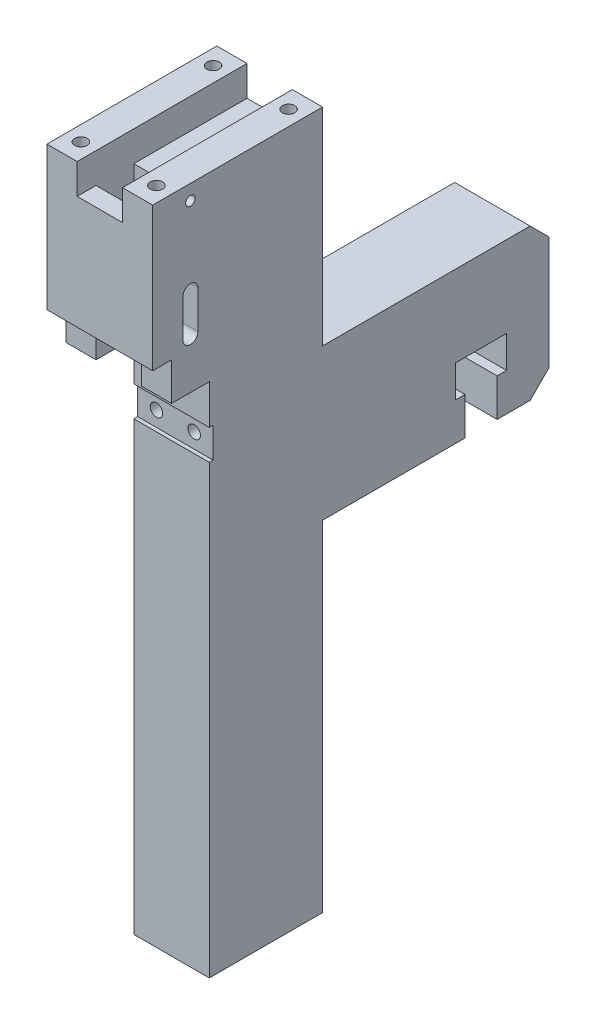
ISO-10303-21;
HEADER;
FILE_DESCRIPTION(('STEP AP214'),'2;1');
FILE_NAME('part.step','',(''),(''),'','','');
FILE_SCHEMA(('AUTOMOTIVE_DESIGN { 1 0 10303 214 1 1 1 1 }'));
ENDSEC;
DATA;
#1=APPLICATION_CONTEXT('core data for automotive mechanical design processes');
#2=APPLICATION_PROTOCOL_DEFINITION('international standard','automotive_design',2000,#1);
#3=PRODUCT_CONTEXT('',#1,'mechanical');
#4=PRODUCT('Part','Part','',(#3));
#5=PRODUCT_RELATED_PRODUCT_CATEGORY('part','',(#4));
#6=PRODUCT_DEFINITION_FORMATION('','',#4);
#7=PRODUCT_DEFINITION_CONTEXT('part definition',#1,'design');
#8=PRODUCT_DEFINITION('design','',#6,#7);
#9=PRODUCT_DEFINITION_SHAPE('','',#8);
#10=(LENGTH_UNIT() NAMED_UNIT(*) SI_UNIT(.MILLI.,.METRE.));
#11=(NAMED_UNIT(*) PLANE_ANGLE_UNIT() SI_UNIT($,.RADIAN.));
#12=(NAMED_UNIT(*) SI_UNIT($,.STERADIAN.) SOLID_ANGLE_UNIT());
#13=UNCERTAINTY_MEASURE_WITH_UNIT(LENGTH_MEASURE(1.E-05),#10,'distance_accuracy_value','');
#14=(GEOMETRIC_REPRESENTATION_CONTEXT(3) GLOBAL_UNCERTAINTY_ASSIGNED_CONTEXT((#13)) GLOBAL_UNIT_ASSIGNED_CONTEXT((#10,
#11,#12)) REPRESENTATION_CONTEXT('',''));
#15=CARTESIAN_POINT('',(0.,0.,0.));
#16=DIRECTION('',(0.,0.,1.));
#17=DIRECTION('',(1.,0.,0.));
#18=AXIS2_PLACEMENT_3D('',#15,#16,#17);
#19=CARTESIAN_POINT('',(8.,176.8,105.));
#20=DIRECTION('',(0.,-1.,0.));
#21=DIRECTION('',(0.,0.,-1.));
#22=AXIS2_PLACEMENT_3D('',#19,#20,#21);
#23=PLANE('',#22);
#24=DIRECTION('',(0.,0.,-1.));
#25=VECTOR('',#24,1.);
#26=CARTESIAN_POINT('',(8.,176.8,105.));
#27=LINE('',#26,#25);
#28=CARTESIAN_POINT('',(8.,176.8,90.));
#29=VERTEX_POINT('',#28);
#30=CARTESIAN_POINT('',(8.,176.8,60.));
#31=VERTEX_POINT('',#30);
#32=EDGE_CURVE('E315',#29,#31,#27,.T.);
#33=ORIENTED_EDGE('',*,*,#32,.F.);
#34=DIRECTION('',(-1.,0.,0.));
#35=VECTOR('',#34,1.);
#36=CARTESIAN_POINT('',(8.,176.8,90.));
#37=LINE('',#36,#35);
#38=CARTESIAN_POINT('',(20.,176.8,90.));
#39=VERTEX_POINT('',#38);
#40=EDGE_CURVE('E48',#39,#29,#37,.T.);
#41=ORIENTED_EDGE('',*,*,#40,.F.);
#42=DIRECTION('',(0.,0.,-1.));
#43=VECTOR('',#42,1.);
#44=CARTESIAN_POINT('',(20.,176.8,105.));
#45=LINE('',#44,#43);
#46=CARTESIAN_POINT('',(20.,176.8,60.));
#47=VERTEX_POINT('',#46);
#48=EDGE_CURVE('E314',#39,#47,#45,.T.);
#49=ORIENTED_EDGE('',*,*,#48,.T.);
#50=DIRECTION('',(1.,0.,0.));
#51=VECTOR('',#50,1.);
#52=CARTESIAN_POINT('',(8.,176.8,60.));
#53=LINE('',#52,#51);
#54=EDGE_CURVE('E535',#31,#47,#53,.T.);
#55=ORIENTED_EDGE('',*,*,#54,.F.);
#56=EDGE_LOOP('',(#33,#41,#49,#55));
#57=FACE_BOUND('',#56,.T.);
#58=ADVANCED_FACE('F33',(#57),#23,.F.);
#59=CARTESIAN_POINT('',(0.,136.8,105.));
#60=DIRECTION('',(0.,1.,0.));
#61=DIRECTION('',(0.,0.,1.));
#62=AXIS2_PLACEMENT_3D('',#59,#60,#61);
#63=PLANE('',#62);
#64=DIRECTION('',(1.,0.,0.));
#65=VECTOR('',#64,1.);
#66=CARTESIAN_POINT('',(-77.,136.8,100.));
#67=LINE('',#66,#65);
#68=CARTESIAN_POINT('',(20.,136.8,100.));
#69=VERTEX_POINT('',#68);
#70=CARTESIAN_POINT('',(28.,136.8,100.));
#71=VERTEX_POINT('',#70);
#72=EDGE_CURVE('E517',#69,#71,#67,.T.);
#73=ORIENTED_EDGE('',*,*,#72,.F.);
#74=DIRECTION('',(0.,0.,-1.));
#75=VECTOR('',#74,1.);
#76=CARTESIAN_POINT('',(20.,136.8,105.));
#77=LINE('',#76,#75);
#78=CARTESIAN_POINT('',(20.,136.8,90.));
#79=VERTEX_POINT('',#78);
#80=EDGE_CURVE('E645',#69,#79,#77,.T.);
#81=ORIENTED_EDGE('',*,*,#80,.T.);
#82=DIRECTION('',(1.,0.,0.));
#83=VECTOR('',#82,1.);
#84=CARTESIAN_POINT('',(-77.,136.8,90.));
#85=LINE('',#84,#83);
#86=CARTESIAN_POINT('',(28.,136.8,90.));
#87=VERTEX_POINT('',#86);
#88=EDGE_CURVE('E512',#79,#87,#85,.T.);
#89=ORIENTED_EDGE('',*,*,#88,.T.);
#90=DIRECTION('',(0.,0.,-1.));
#91=VECTOR('',#90,1.);
#92=CARTESIAN_POINT('',(28.,136.8,100.));
#93=LINE('',#92,#91);
#94=EDGE_CURVE('E411',#71,#87,#93,.T.);
#95=ORIENTED_EDGE('',*,*,#94,.F.);
#96=EDGE_LOOP('',(#73,#81,#89,#95));
#97=FACE_BOUND('',#96,.T.);
#98=ADVANCED_FACE('F729',(#97),#63,.F.);
#99=CARTESIAN_POINT('',(-77.,146.8,100.));
#100=DIRECTION('',(0.,0.,1.));
#101=DIRECTION('',(1.,0.,0.));
#102=AXIS2_PLACEMENT_3D('',#99,#100,#101);
#103=PLANE('',#102);
#104=DIRECTION('',(0.,1.,0.));
#105=VECTOR('',#104,1.);
#106=CARTESIAN_POINT('',(20.,0.,100.));
#107=LINE('',#106,#105);
#108=CARTESIAN_POINT('',(20.,146.8,100.));
#109=VERTEX_POINT('',#108);
#110=EDGE_CURVE('E56',#69,#109,#107,.T.);
#111=ORIENTED_EDGE('',*,*,#110,.F.);
#112=ORIENTED_EDGE('',*,*,#72,.T.);
#113=DIRECTION('',(0.,-1.,0.));
#114=VECTOR('',#113,1.);
#115=CARTESIAN_POINT('',(28.,146.8,100.));
#116=LINE('',#115,#114);
#117=CARTESIAN_POINT('',(28.,146.8,100.));
#118=VERTEX_POINT('',#117);
#119=EDGE_CURVE('E408',#118,#71,#116,.T.);
#120=ORIENTED_EDGE('',*,*,#119,.F.);
#121=DIRECTION('',(1.,0.,0.));
#122=VECTOR('',#121,1.);
#123=CARTESIAN_POINT('',(-77.,146.8,100.));
#124=LINE('',#123,#122);
#125=EDGE_CURVE('E471',#109,#118,#124,.T.);
#126=ORIENTED_EDGE('',*,*,#125,.F.);
#127=EDGE_LOOP('',(#111,#112,#120,#126));
#128=FACE_BOUND('',#127,.T.);
#129=ADVANCED_FACE('F731',(#128),#103,.T.);
#130=CARTESIAN_POINT('',(8.,0.,105.));
#131=DIRECTION('',(0.,1.,0.));
#132=DIRECTION('',(0.,0.,1.));
#133=AXIS2_PLACEMENT_3D('',#130,#131,#132);
#134=PLANE('',#133);
#135=DIRECTION('',(1.,0.,0.));
#136=VECTOR('',#135,1.);
#137=CARTESIAN_POINT('',(-77.,0.,60.));
#138=LINE('',#137,#136);
#139=CARTESIAN_POINT('',(7.99999999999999,0.,60.));
#140=VERTEX_POINT('',#139);
#141=CARTESIAN_POINT('',(28.,0.,60.));
#142=VERTEX_POINT('',#141);
#143=EDGE_CURVE('E499',#140,#142,#138,.T.);
#144=ORIENTED_EDGE('',*,*,#143,.T.);
#145=DIRECTION('',(0.,0.,-1.));
#146=VECTOR('',#145,1.);
#147=CARTESIAN_POINT('',(28.,0.,105.));
#148=LINE('',#147,#146);
#149=CARTESIAN_POINT('',(28.,0.,90.));
#150=VERTEX_POINT('',#149);
#151=EDGE_CURVE('E328',#150,#142,#148,.T.);
#152=ORIENTED_EDGE('',*,*,#151,.F.);
#153=DIRECTION('',(1.,0.,0.));
#154=VECTOR('',#153,1.);
#155=CARTESIAN_POINT('',(-77.,0.,90.));
#156=LINE('',#155,#154);
#157=CARTESIAN_POINT('',(7.99999999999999,0.,90.));
#158=VERTEX_POINT('',#157);
#159=EDGE_CURVE('E502',#158,#150,#156,.T.);
#160=ORIENTED_EDGE('',*,*,#159,.F.);
#161=DIRECTION('',(0.,0.,-1.));
#162=VECTOR('',#161,1.);
#163=CARTESIAN_POINT('',(8.,0.,105.));
#164=LINE('',#163,#162);
#165=EDGE_CURVE('E558',#158,#140,#164,.T.);
#166=ORIENTED_EDGE('',*,*,#165,.T.);
#167=EDGE_LOOP('',(#144,#152,#160,#166));
#168=FACE_BOUND('',#167,.T.);
#169=ADVANCED_FACE('F35',(#168),#134,.F.);
#170=CARTESIAN_POINT('',(28.,0.,105.));
#171=DIRECTION('',(-1.,0.,0.));
#172=DIRECTION('',(0.,0.,1.));
#173=AXIS2_PLACEMENT_3D('',#170,#171,#172);
#174=PLANE('',#173);
#175=CARTESIAN_POINT('',(28.,180.8,95.));
#176=DIRECTION('',(1.,0.,0.));
#177=DIRECTION('',(0.,0.,-1.));
#178=AXIS2_PLACEMENT_3D('',#175,#176,#177);
#179=CIRCLE('',#178,1.25);
#180=CARTESIAN_POINT('',(28.,180.8,93.75));
#181=VERTEX_POINT('',#180);
#182=EDGE_CURVE('E373',#181,#181,#179,.T.);
#183=ORIENTED_EDGE('',*,*,#182,.F.);
#184=EDGE_LOOP('',(#183));
#185=FACE_BOUND('',#184,.T.);
#186=DIRECTION('',(0.,1.,0.));
#187=VECTOR('',#186,1.);
#188=CARTESIAN_POINT('',(28.,149.8,93.));
#189=LINE('',#188,#187);
#190=CARTESIAN_POINT('',(28.,149.8,93.));
#191=VERTEX_POINT('',#190);
#192=CARTESIAN_POINT('',(28.,159.8,93.));
#193=VERTEX_POINT('',#192);
#194=EDGE_CURVE('E377',#191,#193,#189,.T.);
#195=ORIENTED_EDGE('',*,*,#194,.F.);
#196=CARTESIAN_POINT('',(28.,149.8,95.));
#197=DIRECTION('',(1.,0.,0.));
#198=DIRECTION('',(0.,0.,-1.));
#199=AXIS2_PLACEMENT_3D('',#196,#197,#198);
#200=CIRCLE('',#199,2.);
#201=CARTESIAN_POINT('',(28.,149.8,97.));
#202=VERTEX_POINT('',#201);
#203=EDGE_CURVE('E372',#202,#191,#200,.T.);
#204=ORIENTED_EDGE('',*,*,#203,.F.);
#205=DIRECTION('',(0.,-1.,0.));
#206=VECTOR('',#205,1.);
#207=CARTESIAN_POINT('',(28.,149.8,97.));
#208=LINE('',#207,#206);
#209=CARTESIAN_POINT('',(28.,159.8,97.));
#210=VERTEX_POINT('',#209);
#211=EDGE_CURVE('E394',#210,#202,#208,.T.);
#212=ORIENTED_EDGE('',*,*,#211,.F.);
#213=CARTESIAN_POINT('',(28.,159.8,95.));
#214=DIRECTION('',(1.,0.,0.));
#215=DIRECTION('',(0.,0.,-1.));
#216=AXIS2_PLACEMENT_3D('',#213,#214,#215);
#217=CIRCLE('',#216,2.);
#218=EDGE_CURVE('E391',#193,#210,#217,.T.);
#219=ORIENTED_EDGE('',*,*,#218,.F.);
#220=EDGE_LOOP('',(#195,#204,#212,#219));
#221=FACE_BOUND('',#220,.T.);
#222=DIRECTION('',(0.,1.,0.));
#223=VECTOR('',#222,1.);
#224=CARTESIAN_POINT('',(28.,130.,60.));
#225=LINE('',#224,#223);
#226=CARTESIAN_POINT('',(28.,130.,60.));
#227=VERTEX_POINT('',#226);
#228=CARTESIAN_POINT('',(28.,184.8,60.));
#229=VERTEX_POINT('',#228);
#230=EDGE_CURVE('E468',#227,#229,#225,.T.);
#231=ORIENTED_EDGE('',*,*,#230,.T.);
#232=DIRECTION('',(0.,0.,-1.));
#233=VECTOR('',#232,1.);
#234=CARTESIAN_POINT('',(28.,184.8,105.));
#235=LINE('',#234,#233);
#236=CARTESIAN_POINT('',(28.,184.8,105.));
#237=VERTEX_POINT('',#236);
#238=EDGE_CURVE('E325',#237,#229,#235,.T.);
#239=ORIENTED_EDGE('',*,*,#238,.F.);
#240=DIRECTION('',(0.,1.,0.));
#241=VECTOR('',#240,1.);
#242=CARTESIAN_POINT('',(28.,0.,105.));
#243=LINE('',#242,#241);
#244=CARTESIAN_POINT('',(28.,146.8,105.));
#245=VERTEX_POINT('',#244);
#246=EDGE_CURVE('E543',#245,#237,#243,.T.);
#247=ORIENTED_EDGE('',*,*,#246,.F.);
#248=DIRECTION('',(0.,0.,-1.));
#249=VECTOR('',#248,1.);
#250=CARTESIAN_POINT('',(28.,146.8,105.));
#251=LINE('',#250,#249);
#252=EDGE_CURVE('E400',#245,#118,#251,.T.);
#253=ORIENTED_EDGE('',*,*,#252,.T.);
#254=ORIENTED_EDGE('',*,*,#119,.T.);
#255=ORIENTED_EDGE('',*,*,#94,.T.);
#256=DIRECTION('',(0.,-1.,0.));
#257=VECTOR('',#256,1.);
#258=CARTESIAN_POINT('',(28.,126.3,90.));
#259=LINE('',#258,#257);
#260=CARTESIAN_POINT('',(28.,126.3,90.));
#261=VERTEX_POINT('',#260);
#262=EDGE_CURVE('E414',#87,#261,#259,.T.);
#263=ORIENTED_EDGE('',*,*,#262,.T.);
#264=DIRECTION('',(0.,0.,-1.));
#265=VECTOR('',#264,1.);
#266=CARTESIAN_POINT('',(28.,126.3,90.));
#267=LINE('',#266,#265);
#268=CARTESIAN_POINT('',(28.,126.3,89.));
#269=VERTEX_POINT('',#268);
#270=EDGE_CURVE('E417',#261,#269,#267,.T.);
#271=ORIENTED_EDGE('',*,*,#270,.T.);
#272=DIRECTION('',(0.,-1.,0.));
#273=VECTOR('',#272,1.);
#274=CARTESIAN_POINT('',(28.,118.3,89.));
#275=LINE('',#274,#273);
#276=CARTESIAN_POINT('',(28.,118.3,89.));
#277=VERTEX_POINT('',#276);
#278=EDGE_CURVE('E420',#269,#277,#275,.T.);
#279=ORIENTED_EDGE('',*,*,#278,.T.);
#280=DIRECTION('',(0.,-1.11022302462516E-13,1.));
#281=VECTOR('',#280,1.);
#282=CARTESIAN_POINT('',(28.,118.3,90.));
#283=LINE('',#282,#281);
#284=CARTESIAN_POINT('',(28.,118.3,90.));
#285=VERTEX_POINT('',#284);
#286=EDGE_CURVE('E423',#277,#285,#283,.T.);
#287=ORIENTED_EDGE('',*,*,#286,.T.);
#288=DIRECTION('',(0.,-1.,0.));
#289=VECTOR('',#288,1.);
#290=CARTESIAN_POINT('',(28.,0.,90.));
#291=LINE('',#290,#289);
#292=EDGE_CURVE('E426',#285,#150,#291,.T.);
#293=ORIENTED_EDGE('',*,*,#292,.T.);
#294=ORIENTED_EDGE('',*,*,#151,.T.);
#295=DIRECTION('',(0.,1.,0.));
#296=VECTOR('',#295,1.);
#297=CARTESIAN_POINT('',(28.,0.,60.));
#298=LINE('',#297,#296);
#299=CARTESIAN_POINT('',(28.,90.,60.));
#300=VERTEX_POINT('',#299);
#301=EDGE_CURVE('E429',#142,#300,#298,.T.);
#302=ORIENTED_EDGE('',*,*,#301,.T.);
#303=DIRECTION('',(0.,0.,-1.));
#304=VECTOR('',#303,1.);
#305=CARTESIAN_POINT('',(28.,90.,60.));
#306=LINE('',#305,#304);
#307=CARTESIAN_POINT('',(28.,90.,22.25));
#308=VERTEX_POINT('',#307);
#309=EDGE_CURVE('E432',#300,#308,#306,.T.);
#310=ORIENTED_EDGE('',*,*,#309,.T.);
#311=DIRECTION('',(0.,1.,0.));
#312=VECTOR('',#311,1.);
#313=CARTESIAN_POINT('',(28.,100.,22.25));
#314=LINE('',#313,#312);
#315=CARTESIAN_POINT('',(28.,100.,22.25));
#316=VERTEX_POINT('',#315);
#317=EDGE_CURVE('E435',#308,#316,#314,.T.);
#318=ORIENTED_EDGE('',*,*,#317,.T.);
#319=DIRECTION('',(0.,0.,1.));
#320=VECTOR('',#319,1.);
#321=CARTESIAN_POINT('',(28.,100.,24.75));
#322=LINE('',#321,#320);
#323=CARTESIAN_POINT('',(28.,100.,24.75));
#324=VERTEX_POINT('',#323);
#325=EDGE_CURVE('E438',#316,#324,#322,.T.);
#326=ORIENTED_EDGE('',*,*,#325,.T.);
#327=DIRECTION('',(0.,1.,0.));
#328=VECTOR('',#327,1.);
#329=CARTESIAN_POINT('',(28.,108.5,24.75));
#330=LINE('',#329,#328);
#331=CARTESIAN_POINT('',(28.,108.5,24.75));
#332=VERTEX_POINT('',#331);
#333=EDGE_CURVE('E441',#324,#332,#330,.T.);
#334=ORIENTED_EDGE('',*,*,#333,.T.);
#335=DIRECTION('',(0.,0.,-1.));
#336=VECTOR('',#335,1.);
#337=CARTESIAN_POINT('',(28.,108.5,24.75));
#338=LINE('',#337,#336);
#339=CARTESIAN_POINT('',(28.,108.5,11.25));
#340=VERTEX_POINT('',#339);
#341=EDGE_CURVE('E444',#332,#340,#338,.T.);
#342=ORIENTED_EDGE('',*,*,#341,.T.);
#343=DIRECTION('',(0.,-1.,0.));
#344=VECTOR('',#343,1.);
#345=CARTESIAN_POINT('',(28.,108.5,11.25));
#346=LINE('',#345,#344);
#347=CARTESIAN_POINT('',(28.,100.,11.25));
#348=VERTEX_POINT('',#347);
#349=EDGE_CURVE('E447',#340,#348,#346,.T.);
#350=ORIENTED_EDGE('',*,*,#349,.T.);
#351=DIRECTION('',(0.,0.,1.));
#352=VECTOR('',#351,1.);
#353=CARTESIAN_POINT('',(28.,100.,13.75));
#354=LINE('',#353,#352);
#355=CARTESIAN_POINT('',(28.,100.,13.75));
#356=VERTEX_POINT('',#355);
#357=EDGE_CURVE('E450',#348,#356,#354,.T.);
#358=ORIENTED_EDGE('',*,*,#357,.T.);
#359=DIRECTION('',(0.,-1.,0.));
#360=VECTOR('',#359,1.);
#361=CARTESIAN_POINT('',(28.,100.,13.75));
#362=LINE('',#361,#360);
#363=CARTESIAN_POINT('',(28.,90.,13.75));
#364=VERTEX_POINT('',#363);
#365=EDGE_CURVE('E453',#356,#364,#362,.T.);
#366=ORIENTED_EDGE('',*,*,#365,.T.);
#367=DIRECTION('',(0.,0.,-1.));
#368=VECTOR('',#367,1.);
#369=CARTESIAN_POINT('',(28.,90.,13.75));
#370=LINE('',#369,#368);
#371=CARTESIAN_POINT('',(28.,90.,5.));
#372=VERTEX_POINT('',#371);
#373=EDGE_CURVE('E456',#364,#372,#370,.T.);
#374=ORIENTED_EDGE('',*,*,#373,.T.);
#375=DIRECTION('',(0.,0.707106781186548,-0.707106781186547));
#376=VECTOR('',#375,1.);
#377=CARTESIAN_POINT('',(28.,95.,0.));
#378=LINE('',#377,#376);
#379=CARTESIAN_POINT('',(28.,95.,0.));
#380=VERTEX_POINT('',#379);
#381=EDGE_CURVE('E459',#372,#380,#378,.T.);
#382=ORIENTED_EDGE('',*,*,#381,.T.);
#383=DIRECTION('',(0.,1.,0.));
#384=VECTOR('',#383,1.);
#385=CARTESIAN_POINT('',(28.,0.,0.));
#386=LINE('',#385,#384);
#387=CARTESIAN_POINT('',(28.,125.,0.));
#388=VERTEX_POINT('',#387);
#389=EDGE_CURVE('E542',#380,#388,#386,.T.);
#390=ORIENTED_EDGE('',*,*,#389,.T.);
#391=DIRECTION('',(0.,0.707106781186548,0.707106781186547));
#392=VECTOR('',#391,1.);
#393=CARTESIAN_POINT('',(28.,130.,5.));
#394=LINE('',#393,#392);
#395=CARTESIAN_POINT('',(28.,130.,5.));
#396=VERTEX_POINT('',#395);
#397=EDGE_CURVE('E462',#388,#396,#394,.T.);
#398=ORIENTED_EDGE('',*,*,#397,.T.);
#399=DIRECTION('',(0.,0.,1.));
#400=VECTOR('',#399,1.);
#401=CARTESIAN_POINT('',(28.,130.,60.));
#402=LINE('',#401,#400);
#403=EDGE_CURVE('E465',#396,#227,#402,.T.);
#404=ORIENTED_EDGE('',*,*,#403,.T.);
#405=EDGE_LOOP('',(#231,#239,#247,#253,#254,#255,#263,#271,#279,#287,#293,#294,#302,#310,#318,
#326,#334,#342,#350,#358,#366,#374,#382,#390,#398,#404));
#406=FACE_BOUND('',#405,.T.);
#407=ADVANCED_FACE('F601',(#185,#221,#406),#174,.F.);
#408=CARTESIAN_POINT('',(20.,184.8,105.));
#409=DIRECTION('',(0.,-1.,0.));
#410=DIRECTION('',(0.,0.,-1.));
#411=AXIS2_PLACEMENT_3D('',#408,#409,#410);
#412=PLANE('',#411);
#413=CARTESIAN_POINT('',(24.,184.8,100.));
#414=DIRECTION('',(0.,1.,0.));
#415=DIRECTION('',(0.,0.,1.));
#416=AXIS2_PLACEMENT_3D('',#413,#414,#415);
#417=CIRCLE('',#416,1.65000000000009);
#418=CARTESIAN_POINT('',(24.,184.8,101.65));
#419=VERTEX_POINT('',#418);
#420=EDGE_CURVE('E664',#419,#419,#417,.T.);
#421=ORIENTED_EDGE('',*,*,#420,.F.);
#422=EDGE_LOOP('',(#421));
#423=FACE_BOUND('',#422,.T.);
#424=CARTESIAN_POINT('',(24.,184.8,65.0000000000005));
#425=DIRECTION('',(0.,1.,0.));
#426=DIRECTION('',(0.,0.,1.));
#427=AXIS2_PLACEMENT_3D('',#424,#425,#426);
#428=CIRCLE('',#427,1.65000000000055);
#429=CARTESIAN_POINT('',(24.,184.8,66.650000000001));
#430=VERTEX_POINT('',#429);
#431=EDGE_CURVE('E670',#430,#430,#428,.T.);
#432=ORIENTED_EDGE('',*,*,#431,.F.);
#433=EDGE_LOOP('',(#432));
#434=FACE_BOUND('',#433,.T.);
#435=DIRECTION('',(1.,0.,0.));
#436=VECTOR('',#435,1.);
#437=CARTESIAN_POINT('',(-77.,184.8,60.));
#438=LINE('',#437,#436);
#439=CARTESIAN_POINT('',(20.,184.8,60.));
#440=VERTEX_POINT('',#439);
#441=EDGE_CURVE('E472',#440,#229,#438,.T.);
#442=ORIENTED_EDGE('',*,*,#441,.F.);
#443=DIRECTION('',(0.,0.,-1.));
#444=VECTOR('',#443,1.);
#445=CARTESIAN_POINT('',(20.,184.8,105.));
#446=LINE('',#445,#444);
#447=CARTESIAN_POINT('',(20.,184.8,105.));
#448=VERTEX_POINT('',#447);
#449=EDGE_CURVE('E322',#448,#440,#446,.T.);
#450=ORIENTED_EDGE('',*,*,#449,.F.);
#451=DIRECTION('',(-1.,0.,0.));
#452=VECTOR('',#451,1.);
#453=CARTESIAN_POINT('',(20.,184.8,105.));
#454=LINE('',#453,#452);
#455=EDGE_CURVE('E545',#237,#448,#454,.T.);
#456=ORIENTED_EDGE('',*,*,#455,.F.);
#457=ORIENTED_EDGE('',*,*,#238,.T.);
#458=EDGE_LOOP('',(#442,#450,#456,#457));
#459=FACE_BOUND('',#458,.T.);
#460=ADVANCED_FACE('F596',(#423,#434,#459),#412,.F.);
#461=CARTESIAN_POINT('',(20.,176.8,105.));
#462=DIRECTION('',(1.,0.,0.));
#463=DIRECTION('',(0.,0.,-1.));
#464=AXIS2_PLACEMENT_3D('',#461,#462,#463);
#465=PLANE('',#464);
#466=CARTESIAN_POINT('',(20.,180.8,95.));
#467=DIRECTION('',(1.,0.,0.));
#468=DIRECTION('',(0.,0.,-1.));
#469=AXIS2_PLACEMENT_3D('',#466,#467,#468);
#470=CIRCLE('',#469,1.25);
#471=CARTESIAN_POINT('',(20.,180.8,93.75));
#472=VERTEX_POINT('',#471);
#473=EDGE_CURVE('E370',#472,#472,#470,.T.);
#474=ORIENTED_EDGE('',*,*,#473,.T.);
#475=EDGE_LOOP('',(#474));
#476=FACE_BOUND('',#475,.T.);
#477=DIRECTION('',(0.,1.,0.));
#478=VECTOR('',#477,1.);
#479=CARTESIAN_POINT('',(20.,176.8,60.));
#480=LINE('',#479,#478);
#481=EDGE_CURVE('E538',#47,#440,#480,.T.);
#482=ORIENTED_EDGE('',*,*,#481,.F.);
#483=ORIENTED_EDGE('',*,*,#48,.F.);
#484=DIRECTION('',(0.,1.,0.));
#485=VECTOR('',#484,1.);
#486=CARTESIAN_POINT('',(20.,0.,90.));
#487=LINE('',#486,#485);
#488=EDGE_CURVE('E589',#79,#39,#487,.T.);
#489=ORIENTED_EDGE('',*,*,#488,.F.);
#490=ORIENTED_EDGE('',*,*,#80,.F.);
#491=ORIENTED_EDGE('',*,*,#110,.T.);
#492=CARTESIAN_POINT('',(20.,176.8,100.));
#493=VERTEX_POINT('',#492);
#494=EDGE_CURVE('E630',#109,#493,#107,.T.);
#495=ORIENTED_EDGE('',*,*,#494,.T.);
#496=CARTESIAN_POINT('',(20.,176.8,105.));
#497=VERTEX_POINT('',#496);
#498=EDGE_CURVE('E308',#497,#493,#45,.T.);
#499=ORIENTED_EDGE('',*,*,#498,.F.);
#500=DIRECTION('',(0.,-1.,0.));
#501=VECTOR('',#500,1.);
#502=CARTESIAN_POINT('',(20.,176.8,105.));
#503=LINE('',#502,#501);
#504=EDGE_CURVE('E548',#448,#497,#503,.T.);
#505=ORIENTED_EDGE('',*,*,#504,.F.);
#506=ORIENTED_EDGE('',*,*,#449,.T.);
#507=EDGE_LOOP('',(#482,#483,#489,#490,#491,#495,#499,#505,#506));
#508=FACE_BOUND('',#507,.T.);
#509=DIRECTION('',(0.,-1.,0.));
#510=VECTOR('',#509,1.);
#511=CARTESIAN_POINT('',(20.,149.8,93.));
#512=LINE('',#511,#510);
#513=CARTESIAN_POINT('',(20.,159.8,93.));
#514=VERTEX_POINT('',#513);
#515=CARTESIAN_POINT('',(20.,149.8,93.));
#516=VERTEX_POINT('',#515);
#517=EDGE_CURVE('E12',#514,#516,#512,.T.);
#518=ORIENTED_EDGE('',*,*,#517,.F.);
#519=CARTESIAN_POINT('',(20.,159.8,95.));
#520=DIRECTION('',(1.,0.,0.));
#521=DIRECTION('',(0.,0.,-1.));
#522=AXIS2_PLACEMENT_3D('',#519,#520,#521);
#523=CIRCLE('',#522,2.);
#524=CARTESIAN_POINT('',(20.,159.8,97.));
#525=VERTEX_POINT('',#524);
#526=EDGE_CURVE('E636',#525,#514,#523,.F.);
#527=ORIENTED_EDGE('',*,*,#526,.F.);
#528=DIRECTION('',(0.,1.,0.));
#529=VECTOR('',#528,1.);
#530=CARTESIAN_POINT('',(20.,149.8,97.));
#531=LINE('',#530,#529);
#532=CARTESIAN_POINT('',(20.,149.8,97.));
#533=VERTEX_POINT('',#532);
#534=EDGE_CURVE('E639',#533,#525,#531,.T.);
#535=ORIENTED_EDGE('',*,*,#534,.F.);
#536=CARTESIAN_POINT('',(20.,149.8,95.));
#537=DIRECTION('',(1.,0.,0.));
#538=DIRECTION('',(0.,0.,-1.));
#539=AXIS2_PLACEMENT_3D('',#536,#537,#538);
#540=CIRCLE('',#539,2.);
#541=EDGE_CURVE('E642',#516,#533,#540,.F.);
#542=ORIENTED_EDGE('',*,*,#541,.F.);
#543=EDGE_LOOP('',(#518,#527,#535,#542));
#544=FACE_BOUND('',#543,.T.);
#545=ADVANCED_FACE('F587',(#476,#508,#544),#465,.F.);
#546=ORIENTED_EDGE('',*,*,#498,.T.);
#547=DIRECTION('',(1.,0.,0.));
#548=VECTOR('',#547,1.);
#549=CARTESIAN_POINT('',(8.,176.8,100.));
#550=LINE('',#549,#548);
#551=CARTESIAN_POINT('',(8.,176.8,100.));
#552=VERTEX_POINT('',#551);
#553=EDGE_CURVE('E291',#552,#493,#550,.T.);
#554=ORIENTED_EDGE('',*,*,#553,.F.);
#555=CARTESIAN_POINT('',(8.,176.8,105.));
#556=VERTEX_POINT('',#555);
#557=EDGE_CURVE('E305',#556,#552,#27,.T.);
#558=ORIENTED_EDGE('',*,*,#557,.F.);
#559=DIRECTION('',(-1.,0.,0.));
#560=VECTOR('',#559,1.);
#561=CARTESIAN_POINT('',(8.,176.8,105.));
#562=LINE('',#561,#560);
#563=EDGE_CURVE('E550',#497,#556,#562,.T.);
#564=ORIENTED_EDGE('',*,*,#563,.F.);
#565=EDGE_LOOP('',(#546,#554,#558,#564));
#566=FACE_BOUND('',#565,.T.);
#567=ADVANCED_FACE('F303',(#566),#23,.F.);
#568=CARTESIAN_POINT('',(8.,176.8,105.));
#569=DIRECTION('',(-1.,0.,0.));
#570=DIRECTION('',(0.,0.,1.));
#571=AXIS2_PLACEMENT_3D('',#568,#569,#570);
#572=PLANE('',#571);
#573=DIRECTION('',(0.,-1.,0.));
#574=VECTOR('',#573,1.);
#575=CARTESIAN_POINT('',(8.,176.8,60.));
#576=LINE('',#575,#574);
#577=CARTESIAN_POINT('',(7.99999999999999,184.8,60.));
#578=VERTEX_POINT('',#577);
#579=EDGE_CURVE('E532',#578,#31,#576,.T.);
#580=ORIENTED_EDGE('',*,*,#579,.F.);
#581=DIRECTION('',(0.,0.,-1.));
#582=VECTOR('',#581,1.);
#583=CARTESIAN_POINT('',(8.,184.8,105.));
#584=LINE('',#583,#582);
#585=CARTESIAN_POINT('',(8.,184.8,105.));
#586=VERTEX_POINT('',#585);
#587=EDGE_CURVE('E318',#586,#578,#584,.T.);
#588=ORIENTED_EDGE('',*,*,#587,.F.);
#589=DIRECTION('',(0.,1.,0.));
#590=VECTOR('',#589,1.);
#591=CARTESIAN_POINT('',(8.,176.8,105.));
#592=LINE('',#591,#590);
#593=EDGE_CURVE('E313',#556,#586,#592,.T.);
#594=ORIENTED_EDGE('',*,*,#593,.F.);
#595=ORIENTED_EDGE('',*,*,#557,.T.);
#596=DIRECTION('',(0.,1.,0.));
#597=VECTOR('',#596,1.);
#598=CARTESIAN_POINT('',(8.,0.,100.));
#599=LINE('',#598,#597);
#600=CARTESIAN_POINT('',(8.,146.8,100.));
#601=VERTEX_POINT('',#600);
#602=EDGE_CURVE('E288',#601,#552,#599,.T.);
#603=ORIENTED_EDGE('',*,*,#602,.F.);
#604=CARTESIAN_POINT('',(8.,136.8,100.));
#605=VERTEX_POINT('',#604);
#606=EDGE_CURVE('E298',#605,#601,#599,.T.);
#607=ORIENTED_EDGE('',*,*,#606,.F.);
#608=DIRECTION('',(0.,0.,1.));
#609=VECTOR('',#608,1.);
#610=CARTESIAN_POINT('',(8.,136.8,105.));
#611=LINE('',#610,#609);
#612=CARTESIAN_POINT('',(8.,136.8,90.));
#613=VERTEX_POINT('',#612);
#614=EDGE_CURVE('E618',#613,#605,#611,.T.);
#615=ORIENTED_EDGE('',*,*,#614,.F.);
#616=DIRECTION('',(0.,1.,0.));
#617=VECTOR('',#616,1.);
#618=CARTESIAN_POINT('',(8.,0.,90.));
#619=LINE('',#618,#617);
#620=EDGE_CURVE('E299',#613,#29,#619,.T.);
#621=ORIENTED_EDGE('',*,*,#620,.T.);
#622=ORIENTED_EDGE('',*,*,#32,.T.);
#623=EDGE_LOOP('',(#580,#588,#594,#595,#603,#607,#615,#621,#622));
#624=FACE_BOUND('',#623,.T.);
#625=ADVANCED_FACE('F311',(#624),#572,.F.);
#626=CARTESIAN_POINT('',(0.,184.8,105.));
#627=DIRECTION('',(0.,-1.,0.));
#628=DIRECTION('',(0.,0.,-1.));
#629=AXIS2_PLACEMENT_3D('',#626,#627,#628);
#630=PLANE('',#629);
#631=CARTESIAN_POINT('',(4.,184.8,100.));
#632=DIRECTION('',(0.,1.,0.));
#633=DIRECTION('',(0.,0.,1.));
#634=AXIS2_PLACEMENT_3D('',#631,#632,#633);
#635=CIRCLE('',#634,1.65000000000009);
#636=CARTESIAN_POINT('',(4.,184.8,101.65));
#637=VERTEX_POINT('',#636);
#638=EDGE_CURVE('E658',#637,#637,#635,.T.);
#639=ORIENTED_EDGE('',*,*,#638,.F.);
#640=EDGE_LOOP('',(#639));
#641=FACE_BOUND('',#640,.T.);
#642=CARTESIAN_POINT('',(4.,184.8,65.));
#643=DIRECTION('',(0.,1.,0.));
#644=DIRECTION('',(0.,0.,1.));
#645=AXIS2_PLACEMENT_3D('',#642,#643,#644);
#646=CIRCLE('',#645,1.65000000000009);
#647=CARTESIAN_POINT('',(4.,184.8,66.6500000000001));
#648=VERTEX_POINT('',#647);
#649=EDGE_CURVE('E676',#648,#648,#646,.T.);
#650=ORIENTED_EDGE('',*,*,#649,.F.);
#651=EDGE_LOOP('',(#650));
#652=FACE_BOUND('',#651,.T.);
#653=CARTESIAN_POINT('',(0.,184.8,60.));
#654=VERTEX_POINT('',#653);
#655=EDGE_CURVE('E474',#654,#578,#438,.T.);
#656=ORIENTED_EDGE('',*,*,#655,.F.);
#657=DIRECTION('',(0.,0.,-1.));
#658=VECTOR('',#657,1.);
#659=CARTESIAN_POINT('',(0.,184.8,105.));
#660=LINE('',#659,#658);
#661=CARTESIAN_POINT('',(0.,184.8,105.));
#662=VERTEX_POINT('',#661);
#663=EDGE_CURVE('E569',#662,#654,#660,.T.);
#664=ORIENTED_EDGE('',*,*,#663,.F.);
#665=DIRECTION('',(-1.,0.,0.));
#666=VECTOR('',#665,1.);
#667=CARTESIAN_POINT('',(0.,184.8,105.));
#668=LINE('',#667,#666);
#669=EDGE_CURVE('E553',#586,#662,#668,.T.);
#670=ORIENTED_EDGE('',*,*,#669,.F.);
#671=ORIENTED_EDGE('',*,*,#587,.T.);
#672=EDGE_LOOP('',(#656,#664,#670,#671));
#673=FACE_BOUND('',#672,.T.);
#674=ADVANCED_FACE('F579',(#641,#652,#673),#630,.F.);
#675=CARTESIAN_POINT('',(0.,136.8,105.));
#676=DIRECTION('',(1.,0.,0.));
#677=DIRECTION('',(0.,0.,-1.));
#678=AXIS2_PLACEMENT_3D('',#675,#676,#677);
#679=PLANE('',#678);
#680=DIRECTION('',(0.,1.,0.));
#681=VECTOR('',#680,1.);
#682=CARTESIAN_POINT('',(0.,136.8,60.));
#683=LINE('',#682,#681);
#684=CARTESIAN_POINT('',(0.,136.8,60.));
#685=VERTEX_POINT('',#684);
#686=EDGE_CURVE('E530',#685,#654,#683,.T.);
#687=ORIENTED_EDGE('',*,*,#686,.F.);
#688=DIRECTION('',(0.,0.,-1.));
#689=VECTOR('',#688,1.);
#690=CARTESIAN_POINT('',(0.,136.8,105.));
#691=LINE('',#690,#689);
#692=CARTESIAN_POINT('',(0.,136.8,100.));
#693=VERTEX_POINT('',#692);
#694=EDGE_CURVE('E568',#693,#685,#691,.T.);
#695=ORIENTED_EDGE('',*,*,#694,.F.);
#696=DIRECTION('',(0.,-1.,0.));
#697=VECTOR('',#696,1.);
#698=CARTESIAN_POINT('',(0.,136.8,100.));
#699=LINE('',#698,#697);
#700=CARTESIAN_POINT('',(0.,146.8,100.));
#701=VERTEX_POINT('',#700);
#702=EDGE_CURVE('E540',#701,#693,#699,.T.);
#703=ORIENTED_EDGE('',*,*,#702,.F.);
#704=DIRECTION('',(0.,0.,-1.));
#705=VECTOR('',#704,1.);
#706=CARTESIAN_POINT('',(0.,146.8,105.));
#707=LINE('',#706,#705);
#708=CARTESIAN_POINT('',(0.,146.8,105.));
#709=VERTEX_POINT('',#708);
#710=EDGE_CURVE('E525',#709,#701,#707,.T.);
#711=ORIENTED_EDGE('',*,*,#710,.F.);
#712=DIRECTION('',(0.,-1.,0.));
#713=VECTOR('',#712,1.);
#714=CARTESIAN_POINT('',(0.,136.8,105.));
#715=LINE('',#714,#713);
#716=EDGE_CURVE('E555',#662,#709,#715,.T.);
#717=ORIENTED_EDGE('',*,*,#716,.F.);
#718=ORIENTED_EDGE('',*,*,#663,.T.);
#719=EDGE_LOOP('',(#687,#695,#703,#711,#717,#718));
#720=FACE_BOUND('',#719,.T.);
#721=ADVANCED_FACE('F620',(#720),#679,.F.);
#722=DIRECTION('',(0.,0.,-1.));
#723=VECTOR('',#722,1.);
#724=CARTESIAN_POINT('',(8.,136.8,105.));
#725=LINE('',#724,#723);
#726=CARTESIAN_POINT('',(8.,136.8,60.));
#727=VERTEX_POINT('',#726);
#728=EDGE_CURVE('E565',#613,#727,#725,.T.);
#729=ORIENTED_EDGE('',*,*,#728,.F.);
#730=ORIENTED_EDGE('',*,*,#614,.T.);
#731=EDGE_CURVE('E514',#693,#605,#67,.T.);
#732=ORIENTED_EDGE('',*,*,#731,.F.);
#733=ORIENTED_EDGE('',*,*,#694,.T.);
#734=DIRECTION('',(-1.,0.,0.));
#735=VECTOR('',#734,1.);
#736=CARTESIAN_POINT('',(0.,136.8,60.));
#737=LINE('',#736,#735);
#738=EDGE_CURVE('E527',#727,#685,#737,.T.);
#739=ORIENTED_EDGE('',*,*,#738,.F.);
#740=EDGE_LOOP('',(#729,#730,#732,#733,#739));
#741=FACE_BOUND('',#740,.T.);
#742=ADVANCED_FACE('F616',(#741),#63,.F.);
#743=CARTESIAN_POINT('',(8.,0.,105.));
#744=DIRECTION('',(1.,0.,0.));
#745=DIRECTION('',(0.,0.,-1.));
#746=AXIS2_PLACEMENT_3D('',#743,#744,#745);
#747=PLANE('',#746);
#748=DIRECTION('',(0.,1.,0.));
#749=VECTOR('',#748,1.);
#750=CARTESIAN_POINT('',(8.,0.,60.));
#751=LINE('',#750,#749);
#752=CARTESIAN_POINT('',(7.99999999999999,130.,60.));
#753=VERTEX_POINT('',#752);
#754=EDGE_CURVE('E41',#753,#727,#751,.T.);
#755=ORIENTED_EDGE('',*,*,#754,.F.);
#756=DIRECTION('',(0.,0.,1.));
#757=VECTOR('',#756,1.);
#758=CARTESIAN_POINT('',(8.,130.,105.));
#759=LINE('',#758,#757);
#760=CARTESIAN_POINT('',(7.99999999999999,130.,5.));
#761=VERTEX_POINT('',#760);
#762=EDGE_CURVE('E368',#761,#753,#759,.T.);
#763=ORIENTED_EDGE('',*,*,#762,.F.);
#764=DIRECTION('',(0.,0.707106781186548,0.707106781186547));
#765=VECTOR('',#764,1.);
#766=CARTESIAN_POINT('',(8.,115.,-10.));
#767=LINE('',#766,#765);
#768=CARTESIAN_POINT('',(7.99999999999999,125.,0.));
#769=VERTEX_POINT('',#768);
#770=EDGE_CURVE('E523',#769,#761,#767,.T.);
#771=ORIENTED_EDGE('',*,*,#770,.F.);
#772=DIRECTION('',(0.,-1.,0.));
#773=VECTOR('',#772,1.);
#774=CARTESIAN_POINT('',(8.,0.,0.));
#775=LINE('',#774,#773);
#776=CARTESIAN_POINT('',(8.,95.,0.));
#777=VERTEX_POINT('',#776);
#778=EDGE_CURVE('E546',#769,#777,#775,.T.);
#779=ORIENTED_EDGE('',*,*,#778,.T.);
#780=DIRECTION('',(0.,0.707106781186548,-0.707106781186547));
#781=VECTOR('',#780,1.);
#782=CARTESIAN_POINT('',(8.,-5.00000000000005,99.9999999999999));
#783=LINE('',#782,#781);
#784=CARTESIAN_POINT('',(7.99999999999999,90.,5.));
#785=VERTEX_POINT('',#784);
#786=EDGE_CURVE('E521',#785,#777,#783,.T.);
#787=ORIENTED_EDGE('',*,*,#786,.F.);
#788=DIRECTION('',(0.,0.,-1.));
#789=VECTOR('',#788,1.);
#790=CARTESIAN_POINT('',(8.,90.,105.));
#791=LINE('',#790,#789);
#792=CARTESIAN_POINT('',(7.99999999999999,90.,13.75));
#793=VERTEX_POINT('',#792);
#794=EDGE_CURVE('E366',#793,#785,#791,.T.);
#795=ORIENTED_EDGE('',*,*,#794,.F.);
#796=DIRECTION('',(0.,-1.,0.));
#797=VECTOR('',#796,1.);
#798=CARTESIAN_POINT('',(8.,0.,13.75));
#799=LINE('',#798,#797);
#800=CARTESIAN_POINT('',(7.99999999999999,100.,13.75));
#801=VERTEX_POINT('',#800);
#802=EDGE_CURVE('E364',#801,#793,#799,.T.);
#803=ORIENTED_EDGE('',*,*,#802,.F.);
#804=DIRECTION('',(0.,0.,1.));
#805=VECTOR('',#804,1.);
#806=CARTESIAN_POINT('',(8.,100.,105.));
#807=LINE('',#806,#805);
#808=CARTESIAN_POINT('',(7.99999999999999,100.,11.25));
#809=VERTEX_POINT('',#808);
#810=EDGE_CURVE('E362',#809,#801,#807,.T.);
#811=ORIENTED_EDGE('',*,*,#810,.F.);
#812=DIRECTION('',(0.,-1.,0.));
#813=VECTOR('',#812,1.);
#814=CARTESIAN_POINT('',(8.,0.,11.25));
#815=LINE('',#814,#813);
#816=CARTESIAN_POINT('',(7.99999999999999,108.5,11.25));
#817=VERTEX_POINT('',#816);
#818=EDGE_CURVE('E360',#817,#809,#815,.T.);
#819=ORIENTED_EDGE('',*,*,#818,.F.);
#820=DIRECTION('',(0.,0.,-1.));
#821=VECTOR('',#820,1.);
#822=CARTESIAN_POINT('',(8.,108.5,105.));
#823=LINE('',#822,#821);
#824=CARTESIAN_POINT('',(7.99999999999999,108.5,24.75));
#825=VERTEX_POINT('',#824);
#826=EDGE_CURVE('E358',#825,#817,#823,.T.);
#827=ORIENTED_EDGE('',*,*,#826,.F.);
#828=DIRECTION('',(0.,1.,0.));
#829=VECTOR('',#828,1.);
#830=CARTESIAN_POINT('',(8.,0.,24.75));
#831=LINE('',#830,#829);
#832=CARTESIAN_POINT('',(7.99999999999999,100.,24.75));
#833=VERTEX_POINT('',#832);
#834=EDGE_CURVE('E356',#833,#825,#831,.T.);
#835=ORIENTED_EDGE('',*,*,#834,.F.);
#836=DIRECTION('',(0.,0.,1.));
#837=VECTOR('',#836,1.);
#838=CARTESIAN_POINT('',(8.,100.,105.));
#839=LINE('',#838,#837);
#840=CARTESIAN_POINT('',(7.99999999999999,100.,22.25));
#841=VERTEX_POINT('',#840);
#842=EDGE_CURVE('E354',#841,#833,#839,.T.);
#843=ORIENTED_EDGE('',*,*,#842,.F.);
#844=DIRECTION('',(0.,1.,0.));
#845=VECTOR('',#844,1.);
#846=CARTESIAN_POINT('',(8.,0.,22.25));
#847=LINE('',#846,#845);
#848=CARTESIAN_POINT('',(7.99999999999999,90.,22.25));
#849=VERTEX_POINT('',#848);
#850=EDGE_CURVE('E352',#849,#841,#847,.T.);
#851=ORIENTED_EDGE('',*,*,#850,.F.);
#852=DIRECTION('',(0.,0.,-1.));
#853=VECTOR('',#852,1.);
#854=CARTESIAN_POINT('',(8.,90.,105.));
#855=LINE('',#854,#853);
#856=CARTESIAN_POINT('',(7.99999999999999,90.,60.));
#857=VERTEX_POINT('',#856);
#858=EDGE_CURVE('E350',#857,#849,#855,.T.);
#859=ORIENTED_EDGE('',*,*,#858,.F.);
#860=DIRECTION('',(0.,1.,0.));
#861=VECTOR('',#860,1.);
#862=CARTESIAN_POINT('',(8.,0.,60.));
#863=LINE('',#862,#861);
#864=EDGE_CURVE('E348',#140,#857,#863,.T.);
#865=ORIENTED_EDGE('',*,*,#864,.F.);
#866=ORIENTED_EDGE('',*,*,#165,.F.);
#867=DIRECTION('',(0.,-1.,0.));
#868=VECTOR('',#867,1.);
#869=CARTESIAN_POINT('',(8.,0.,90.));
#870=LINE('',#869,#868);
#871=CARTESIAN_POINT('',(7.99999999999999,118.3,90.));
#872=VERTEX_POINT('',#871);
#873=EDGE_CURVE('E346',#872,#158,#870,.T.);
#874=ORIENTED_EDGE('',*,*,#873,.F.);
#875=DIRECTION('',(0.,-1.11022302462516E-13,1.));
#876=VECTOR('',#875,1.);
#877=CARTESIAN_POINT('',(8.,118.299999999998,105.000000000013));
#878=LINE('',#877,#876);
#879=CARTESIAN_POINT('',(7.99999999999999,118.3,89.));
#880=VERTEX_POINT('',#879);
#881=EDGE_CURVE('E344',#880,#872,#878,.T.);
#882=ORIENTED_EDGE('',*,*,#881,.F.);
#883=DIRECTION('',(0.,-1.,0.));
#884=VECTOR('',#883,1.);
#885=CARTESIAN_POINT('',(8.,0.,89.));
#886=LINE('',#885,#884);
#887=CARTESIAN_POINT('',(7.99999999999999,126.3,89.));
#888=VERTEX_POINT('',#887);
#889=EDGE_CURVE('E342',#888,#880,#886,.T.);
#890=ORIENTED_EDGE('',*,*,#889,.F.);
#891=DIRECTION('',(0.,0.,-1.));
#892=VECTOR('',#891,1.);
#893=CARTESIAN_POINT('',(8.,126.3,105.));
#894=LINE('',#893,#892);
#895=CARTESIAN_POINT('',(7.99999999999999,126.3,90.));
#896=VERTEX_POINT('',#895);
#897=EDGE_CURVE('E340',#896,#888,#894,.T.);
#898=ORIENTED_EDGE('',*,*,#897,.F.);
#899=DIRECTION('',(0.,-1.,0.));
#900=VECTOR('',#899,1.);
#901=CARTESIAN_POINT('',(8.,0.,90.));
#902=LINE('',#901,#900);
#903=EDGE_CURVE('E338',#613,#896,#902,.T.);
#904=ORIENTED_EDGE('',*,*,#903,.F.);
#905=ORIENTED_EDGE('',*,*,#728,.T.);
#906=EDGE_LOOP('',(#755,#763,#771,#779,#787,#795,#803,#811,#819,#827,#835,#843,#851,#859,#865,
#866,#874,#882,#890,#898,#904,#905));
#907=FACE_BOUND('',#906,.T.);
#908=ADVANCED_FACE('F609',(#907),#747,.F.);
#909=CARTESIAN_POINT('',(28.,0.,105.));
#910=DIRECTION('',(0.,0.,1.));
#911=DIRECTION('',(1.,0.,0.));
#912=AXIS2_PLACEMENT_3D('',#909,#910,#911);
#913=PLANE('',#912);
#914=ORIENTED_EDGE('',*,*,#716,.T.);
#915=DIRECTION('',(1.,0.,0.));
#916=VECTOR('',#915,1.);
#917=CARTESIAN_POINT('',(28.,146.8,105.));
#918=LINE('',#917,#916);
#919=EDGE_CURVE('E335',#709,#245,#918,.T.);
#920=ORIENTED_EDGE('',*,*,#919,.T.);
#921=ORIENTED_EDGE('',*,*,#246,.T.);
#922=ORIENTED_EDGE('',*,*,#455,.T.);
#923=ORIENTED_EDGE('',*,*,#504,.T.);
#924=ORIENTED_EDGE('',*,*,#563,.T.);
#925=ORIENTED_EDGE('',*,*,#593,.T.);
#926=ORIENTED_EDGE('',*,*,#669,.T.);
#927=EDGE_LOOP('',(#914,#920,#921,#922,#923,#924,#925,#926));
#928=FACE_BOUND('',#927,.T.);
#929=ADVANCED_FACE('F629',(#928),#913,.T.);
#930=CARTESIAN_POINT('',(28.,0.,0.));
#931=DIRECTION('',(0.,0.,1.));
#932=DIRECTION('',(1.,0.,0.));
#933=AXIS2_PLACEMENT_3D('',#930,#931,#932);
#934=PLANE('',#933);
#935=DIRECTION('',(-1.,0.,0.));
#936=VECTOR('',#935,1.);
#937=CARTESIAN_POINT('',(28.,125.,0.));
#938=LINE('',#937,#936);
#939=EDGE_CURVE('E333',#388,#769,#938,.T.);
#940=ORIENTED_EDGE('',*,*,#939,.F.);
#941=ORIENTED_EDGE('',*,*,#389,.F.);
#942=DIRECTION('',(1.,0.,0.));
#943=VECTOR('',#942,1.);
#944=CARTESIAN_POINT('',(28.,95.,0.));
#945=LINE('',#944,#943);
#946=EDGE_CURVE('E331',#777,#380,#945,.T.);
#947=ORIENTED_EDGE('',*,*,#946,.F.);
#948=ORIENTED_EDGE('',*,*,#778,.F.);
#949=EDGE_LOOP('',(#940,#941,#947,#948));
#950=FACE_BOUND('',#949,.T.);
#951=ADVANCED_FACE('F807',(#950),#934,.F.);
#952=CARTESIAN_POINT('',(-77.,95.,0.));
#953=DIRECTION('',(0.,-0.707106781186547,-0.707106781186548));
#954=DIRECTION('',(0.,0.707106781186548,-0.707106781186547));
#955=AXIS2_PLACEMENT_3D('',#952,#953,#954);
#956=PLANE('',#955);
#957=ORIENTED_EDGE('',*,*,#786,.T.);
#958=ORIENTED_EDGE('',*,*,#946,.T.);
#959=ORIENTED_EDGE('',*,*,#381,.F.);
#960=DIRECTION('',(1.,0.,0.));
#961=VECTOR('',#960,1.);
#962=CARTESIAN_POINT('',(-77.,90.,5.));
#963=LINE('',#962,#961);
#964=EDGE_CURVE('E479',#785,#372,#963,.T.);
#965=ORIENTED_EDGE('',*,*,#964,.F.);
#966=EDGE_LOOP('',(#957,#958,#959,#965));
#967=FACE_BOUND('',#966,.T.);
#968=ADVANCED_FACE('F803',(#967),#956,.T.);
#969=CARTESIAN_POINT('',(-77.,0.,60.));
#970=DIRECTION('',(0.,0.,-1.));
#971=DIRECTION('',(-1.,0.,0.));
#972=AXIS2_PLACEMENT_3D('',#969,#970,#971);
#973=PLANE('',#972);
#974=ORIENTED_EDGE('',*,*,#864,.T.);
#975=DIRECTION('',(1.,0.,0.));
#976=VECTOR('',#975,1.);
#977=CARTESIAN_POINT('',(-77.,90.,60.));
#978=LINE('',#977,#976);
#979=EDGE_CURVE('E497',#857,#300,#978,.T.);
#980=ORIENTED_EDGE('',*,*,#979,.T.);
#981=ORIENTED_EDGE('',*,*,#301,.F.);
#982=ORIENTED_EDGE('',*,*,#143,.F.);
#983=EDGE_LOOP('',(#974,#980,#981,#982));
#984=FACE_BOUND('',#983,.T.);
#985=ADVANCED_FACE('F806',(#984),#973,.T.);
#986=CARTESIAN_POINT('',(-77.,90.,60.));
#987=DIRECTION('',(0.,-1.,0.));
#988=DIRECTION('',(0.,0.,-1.));
#989=AXIS2_PLACEMENT_3D('',#986,#987,#988);
#990=PLANE('',#989);
#991=ORIENTED_EDGE('',*,*,#858,.T.);
#992=DIRECTION('',(1.,0.,0.));
#993=VECTOR('',#992,1.);
#994=CARTESIAN_POINT('',(-77.,90.,22.25));
#995=LINE('',#994,#993);
#996=EDGE_CURVE('E495',#849,#308,#995,.T.);
#997=ORIENTED_EDGE('',*,*,#996,.T.);
#998=ORIENTED_EDGE('',*,*,#309,.F.);
#999=ORIENTED_EDGE('',*,*,#979,.F.);
#1000=EDGE_LOOP('',(#991,#997,#998,#999));
#1001=FACE_BOUND('',#1000,.T.);
#1002=ADVANCED_FACE('F839',(#1001),#990,.T.);
#1003=CARTESIAN_POINT('',(-77.,100.,22.25));
#1004=DIRECTION('',(0.,0.,-1.));
#1005=DIRECTION('',(-1.,0.,0.));
#1006=AXIS2_PLACEMENT_3D('',#1003,#1004,#1005);
#1007=PLANE('',#1006);
#1008=ORIENTED_EDGE('',*,*,#850,.T.);
#1009=DIRECTION('',(1.,0.,0.));
#1010=VECTOR('',#1009,1.);
#1011=CARTESIAN_POINT('',(-77.,100.,22.25));
#1012=LINE('',#1011,#1010);
#1013=EDGE_CURVE('E493',#841,#316,#1012,.T.);
#1014=ORIENTED_EDGE('',*,*,#1013,.T.);
#1015=ORIENTED_EDGE('',*,*,#317,.F.);
#1016=ORIENTED_EDGE('',*,*,#996,.F.);
#1017=EDGE_LOOP('',(#1008,#1014,#1015,#1016));
#1018=FACE_BOUND('',#1017,.T.);
#1019=ADVANCED_FACE('F835',(#1018),#1007,.T.);
#1020=CARTESIAN_POINT('',(-77.,100.,24.75));
#1021=DIRECTION('',(0.,1.,0.));
#1022=DIRECTION('',(0.,0.,1.));
#1023=AXIS2_PLACEMENT_3D('',#1020,#1021,#1022);
#1024=PLANE('',#1023);
#1025=ORIENTED_EDGE('',*,*,#842,.T.);
#1026=DIRECTION('',(1.,0.,0.));
#1027=VECTOR('',#1026,1.);
#1028=CARTESIAN_POINT('',(-77.,100.,24.75));
#1029=LINE('',#1028,#1027);
#1030=EDGE_CURVE('E491',#833,#324,#1029,.T.);
#1031=ORIENTED_EDGE('',*,*,#1030,.T.);
#1032=ORIENTED_EDGE('',*,*,#325,.F.);
#1033=ORIENTED_EDGE('',*,*,#1013,.F.);
#1034=EDGE_LOOP('',(#1025,#1031,#1032,#1033));
#1035=FACE_BOUND('',#1034,.T.);
#1036=ADVANCED_FACE('F831',(#1035),#1024,.T.);
#1037=CARTESIAN_POINT('',(-77.,108.5,24.75));
#1038=DIRECTION('',(0.,0.,-1.));
#1039=DIRECTION('',(-1.,0.,0.));
#1040=AXIS2_PLACEMENT_3D('',#1037,#1038,#1039);
#1041=PLANE('',#1040);
#1042=ORIENTED_EDGE('',*,*,#834,.T.);
#1043=DIRECTION('',(1.,0.,0.));
#1044=VECTOR('',#1043,1.);
#1045=CARTESIAN_POINT('',(-77.,108.5,24.75));
#1046=LINE('',#1045,#1044);
#1047=EDGE_CURVE('E489',#825,#332,#1046,.T.);
#1048=ORIENTED_EDGE('',*,*,#1047,.T.);
#1049=ORIENTED_EDGE('',*,*,#333,.F.);
#1050=ORIENTED_EDGE('',*,*,#1030,.F.);
#1051=EDGE_LOOP('',(#1042,#1048,#1049,#1050));
#1052=FACE_BOUND('',#1051,.T.);
#1053=ADVANCED_FACE('F827',(#1052),#1041,.T.);
#1054=CARTESIAN_POINT('',(-77.,108.5,24.75));
#1055=DIRECTION('',(0.,-1.,0.));
#1056=DIRECTION('',(0.,0.,-1.));
#1057=AXIS2_PLACEMENT_3D('',#1054,#1055,#1056);
#1058=PLANE('',#1057);
#1059=ORIENTED_EDGE('',*,*,#826,.T.);
#1060=DIRECTION('',(1.,0.,0.));
#1061=VECTOR('',#1060,1.);
#1062=CARTESIAN_POINT('',(-77.,108.5,11.25));
#1063=LINE('',#1062,#1061);
#1064=EDGE_CURVE('E487',#817,#340,#1063,.T.);
#1065=ORIENTED_EDGE('',*,*,#1064,.T.);
#1066=ORIENTED_EDGE('',*,*,#341,.F.);
#1067=ORIENTED_EDGE('',*,*,#1047,.F.);
#1068=EDGE_LOOP('',(#1059,#1065,#1066,#1067));
#1069=FACE_BOUND('',#1068,.T.);
#1070=ADVANCED_FACE('F823',(#1069),#1058,.T.);
#1071=CARTESIAN_POINT('',(-77.,108.5,11.25));
#1072=DIRECTION('',(0.,0.,1.));
#1073=DIRECTION('',(1.,0.,0.));
#1074=AXIS2_PLACEMENT_3D('',#1071,#1072,#1073);
#1075=PLANE('',#1074);
#1076=ORIENTED_EDGE('',*,*,#818,.T.);
#1077=DIRECTION('',(1.,0.,0.));
#1078=VECTOR('',#1077,1.);
#1079=CARTESIAN_POINT('',(-77.,100.,11.25));
#1080=LINE('',#1079,#1078);
#1081=EDGE_CURVE('E485',#809,#348,#1080,.T.);
#1082=ORIENTED_EDGE('',*,*,#1081,.T.);
#1083=ORIENTED_EDGE('',*,*,#349,.F.);
#1084=ORIENTED_EDGE('',*,*,#1064,.F.);
#1085=EDGE_LOOP('',(#1076,#1082,#1083,#1084));
#1086=FACE_BOUND('',#1085,.T.);
#1087=ADVANCED_FACE('F819',(#1086),#1075,.T.);
#1088=CARTESIAN_POINT('',(-77.,100.,13.75));
#1089=DIRECTION('',(0.,1.,0.));
#1090=DIRECTION('',(0.,0.,1.));
#1091=AXIS2_PLACEMENT_3D('',#1088,#1089,#1090);
#1092=PLANE('',#1091);
#1093=ORIENTED_EDGE('',*,*,#810,.T.);
#1094=DIRECTION('',(1.,0.,0.));
#1095=VECTOR('',#1094,1.);
#1096=CARTESIAN_POINT('',(-77.,100.,13.75));
#1097=LINE('',#1096,#1095);
#1098=EDGE_CURVE('E483',#801,#356,#1097,.T.);
#1099=ORIENTED_EDGE('',*,*,#1098,.T.);
#1100=ORIENTED_EDGE('',*,*,#357,.F.);
#1101=ORIENTED_EDGE('',*,*,#1081,.F.);
#1102=EDGE_LOOP('',(#1093,#1099,#1100,#1101));
#1103=FACE_BOUND('',#1102,.T.);
#1104=ADVANCED_FACE('F815',(#1103),#1092,.T.);
#1105=CARTESIAN_POINT('',(-77.,100.,13.75));
#1106=DIRECTION('',(0.,0.,1.));
#1107=DIRECTION('',(1.,0.,0.));
#1108=AXIS2_PLACEMENT_3D('',#1105,#1106,#1107);
#1109=PLANE('',#1108);
#1110=ORIENTED_EDGE('',*,*,#802,.T.);
#1111=DIRECTION('',(1.,0.,0.));
#1112=VECTOR('',#1111,1.);
#1113=CARTESIAN_POINT('',(-77.,90.,13.75));
#1114=LINE('',#1113,#1112);
#1115=EDGE_CURVE('E481',#793,#364,#1114,.T.);
#1116=ORIENTED_EDGE('',*,*,#1115,.T.);
#1117=ORIENTED_EDGE('',*,*,#365,.F.);
#1118=ORIENTED_EDGE('',*,*,#1098,.F.);
#1119=EDGE_LOOP('',(#1110,#1116,#1117,#1118));
#1120=FACE_BOUND('',#1119,.T.);
#1121=ADVANCED_FACE('F811',(#1120),#1109,.T.);
#1122=CARTESIAN_POINT('',(-77.,90.,13.75));
#1123=DIRECTION('',(0.,-1.,0.));
#1124=DIRECTION('',(0.,0.,-1.));
#1125=AXIS2_PLACEMENT_3D('',#1122,#1123,#1124);
#1126=PLANE('',#1125);
#1127=ORIENTED_EDGE('',*,*,#794,.T.);
#1128=ORIENTED_EDGE('',*,*,#964,.T.);
#1129=ORIENTED_EDGE('',*,*,#373,.F.);
#1130=ORIENTED_EDGE('',*,*,#1115,.F.);
#1131=EDGE_LOOP('',(#1127,#1128,#1129,#1130));
#1132=FACE_BOUND('',#1131,.T.);
#1133=ADVANCED_FACE('F801',(#1132),#1126,.T.);
#1134=CARTESIAN_POINT('',(-77.,130.,5.));
#1135=DIRECTION('',(0.,0.707106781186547,-0.707106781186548));
#1136=DIRECTION('',(0.,0.707106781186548,0.707106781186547));
#1137=AXIS2_PLACEMENT_3D('',#1134,#1135,#1136);
#1138=PLANE('',#1137);
#1139=ORIENTED_EDGE('',*,*,#770,.T.);
#1140=DIRECTION('',(1.,0.,0.));
#1141=VECTOR('',#1140,1.);
#1142=CARTESIAN_POINT('',(-77.,130.,5.));
#1143=LINE('',#1142,#1141);
#1144=EDGE_CURVE('E477',#761,#396,#1143,.T.);
#1145=ORIENTED_EDGE('',*,*,#1144,.T.);
#1146=ORIENTED_EDGE('',*,*,#397,.F.);
#1147=ORIENTED_EDGE('',*,*,#939,.T.);
#1148=EDGE_LOOP('',(#1139,#1145,#1146,#1147));
#1149=FACE_BOUND('',#1148,.T.);
#1150=ADVANCED_FACE('F798',(#1149),#1138,.T.);
#1151=CARTESIAN_POINT('',(-77.,130.,60.));
#1152=DIRECTION('',(0.,1.,0.));
#1153=DIRECTION('',(0.,0.,1.));
#1154=AXIS2_PLACEMENT_3D('',#1151,#1152,#1153);
#1155=PLANE('',#1154);
#1156=ORIENTED_EDGE('',*,*,#762,.T.);
#1157=DIRECTION('',(1.,0.,0.));
#1158=VECTOR('',#1157,1.);
#1159=CARTESIAN_POINT('',(-77.,130.,60.));
#1160=LINE('',#1159,#1158);
#1161=EDGE_CURVE('E475',#753,#227,#1160,.T.);
#1162=ORIENTED_EDGE('',*,*,#1161,.T.);
#1163=ORIENTED_EDGE('',*,*,#403,.F.);
#1164=ORIENTED_EDGE('',*,*,#1144,.F.);
#1165=EDGE_LOOP('',(#1156,#1162,#1163,#1164));
#1166=FACE_BOUND('',#1165,.T.);
#1167=ADVANCED_FACE('F794',(#1166),#1155,.T.);
#1168=CARTESIAN_POINT('',(-77.,130.,60.));
#1169=DIRECTION('',(0.,0.,-1.));
#1170=DIRECTION('',(-1.,0.,0.));
#1171=AXIS2_PLACEMENT_3D('',#1168,#1169,#1170);
#1172=PLANE('',#1171);
#1173=CARTESIAN_POINT('',(5.,156.3,60.));
#1174=DIRECTION('',(0.,0.,-1.));
#1175=DIRECTION('',(-1.,0.,0.));
#1176=AXIS2_PLACEMENT_3D('',#1173,#1174,#1175);
#1177=CIRCLE('',#1176,2.10000000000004);
#1178=CARTESIAN_POINT('',(2.89999999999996,156.3,60.));
#1179=VERTEX_POINT('',#1178);
#1180=EDGE_CURVE('E648',#1179,#1179,#1177,.T.);
#1181=ORIENTED_EDGE('',*,*,#1180,.F.);
#1182=EDGE_LOOP('',(#1181));
#1183=FACE_BOUND('',#1182,.T.);
#1184=CARTESIAN_POINT('',(23.0000000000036,156.3,60.));
#1185=DIRECTION('',(0.,0.,-1.));
#1186=DIRECTION('',(-1.,0.,0.));
#1187=AXIS2_PLACEMENT_3D('',#1184,#1185,#1186);
#1188=CIRCLE('',#1187,2.10000000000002);
#1189=CARTESIAN_POINT('',(20.9000000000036,156.3,60.));
#1190=VERTEX_POINT('',#1189);
#1191=EDGE_CURVE('E652',#1190,#1190,#1188,.T.);
#1192=ORIENTED_EDGE('',*,*,#1191,.F.);
#1193=EDGE_LOOP('',(#1192));
#1194=FACE_BOUND('',#1193,.T.);
#1195=ORIENTED_EDGE('',*,*,#481,.T.);
#1196=ORIENTED_EDGE('',*,*,#441,.T.);
#1197=ORIENTED_EDGE('',*,*,#230,.F.);
#1198=ORIENTED_EDGE('',*,*,#1161,.F.);
#1199=ORIENTED_EDGE('',*,*,#754,.T.);
#1200=ORIENTED_EDGE('',*,*,#738,.T.);
#1201=ORIENTED_EDGE('',*,*,#686,.T.);
#1202=ORIENTED_EDGE('',*,*,#655,.T.);
#1203=ORIENTED_EDGE('',*,*,#579,.T.);
#1204=ORIENTED_EDGE('',*,*,#54,.T.);
#1205=EDGE_LOOP('',(#1195,#1196,#1197,#1198,#1199,#1200,#1201,#1202,#1203,#1204));
#1206=FACE_BOUND('',#1205,.T.);
#1207=ADVANCED_FACE('F583',(#1183,#1194,#1206),#1172,.T.);
#1208=ORIENTED_EDGE('',*,*,#606,.T.);
#1209=EDGE_CURVE('E518',#701,#601,#124,.T.);
#1210=ORIENTED_EDGE('',*,*,#1209,.F.);
#1211=ORIENTED_EDGE('',*,*,#702,.T.);
#1212=ORIENTED_EDGE('',*,*,#731,.T.);
#1213=EDGE_LOOP('',(#1208,#1210,#1211,#1212));
#1214=FACE_BOUND('',#1213,.T.);
#1215=ADVANCED_FACE('F625',(#1214),#103,.T.);
#1216=CARTESIAN_POINT('',(-77.,0.,90.));
#1217=DIRECTION('',(0.,0.,1.));
#1218=DIRECTION('',(1.,0.,0.));
#1219=AXIS2_PLACEMENT_3D('',#1216,#1217,#1218);
#1220=PLANE('',#1219);
#1221=ORIENTED_EDGE('',*,*,#292,.F.);
#1222=DIRECTION('',(1.,0.,0.));
#1223=VECTOR('',#1222,1.);
#1224=CARTESIAN_POINT('',(-77.,118.3,90.));
#1225=LINE('',#1224,#1223);
#1226=EDGE_CURVE('E504',#872,#285,#1225,.T.);
#1227=ORIENTED_EDGE('',*,*,#1226,.F.);
#1228=ORIENTED_EDGE('',*,*,#873,.T.);
#1229=ORIENTED_EDGE('',*,*,#159,.T.);
#1230=EDGE_LOOP('',(#1221,#1227,#1228,#1229));
#1231=FACE_BOUND('',#1230,.T.);
#1232=ADVANCED_FACE('F716',(#1231),#1220,.T.);
#1233=CARTESIAN_POINT('',(-77.,118.3,90.));
#1234=DIRECTION('',(0.,1.,1.11022302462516E-13));
#1235=DIRECTION('',(0.,-1.11022302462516E-13,1.));
#1236=AXIS2_PLACEMENT_3D('',#1233,#1234,#1235);
#1237=PLANE('',#1236);
#1238=ORIENTED_EDGE('',*,*,#881,.T.);
#1239=ORIENTED_EDGE('',*,*,#1226,.T.);
#1240=ORIENTED_EDGE('',*,*,#286,.F.);
#1241=DIRECTION('',(1.,0.,0.));
#1242=VECTOR('',#1241,1.);
#1243=CARTESIAN_POINT('',(-77.,118.3,89.));
#1244=LINE('',#1243,#1242);
#1245=EDGE_CURVE('E506',#880,#277,#1244,.T.);
#1246=ORIENTED_EDGE('',*,*,#1245,.F.);
#1247=EDGE_LOOP('',(#1238,#1239,#1240,#1246));
#1248=FACE_BOUND('',#1247,.T.);
#1249=ADVANCED_FACE('F697',(#1248),#1237,.T.);
#1250=CARTESIAN_POINT('',(-77.,118.3,89.));
#1251=DIRECTION('',(0.,0.,1.));
#1252=DIRECTION('',(1.,0.,0.));
#1253=AXIS2_PLACEMENT_3D('',#1250,#1251,#1252);
#1254=PLANE('',#1253);
#1255=CARTESIAN_POINT('',(22.9999999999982,122.3,89.));
#1256=DIRECTION('',(0.,0.,1.));
#1257=DIRECTION('',(1.,0.,0.));
#1258=AXIS2_PLACEMENT_3D('',#1255,#1256,#1257);
#1259=CIRCLE('',#1258,1.65000000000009);
#1260=CARTESIAN_POINT('',(24.6499999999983,122.3,89.));
#1261=VERTEX_POINT('',#1260);
#1262=EDGE_CURVE('E682',#1261,#1261,#1259,.T.);
#1263=ORIENTED_EDGE('',*,*,#1262,.F.);
#1264=EDGE_LOOP('',(#1263));
#1265=FACE_BOUND('',#1264,.T.);
#1266=CARTESIAN_POINT('',(13.,122.3,89.));
#1267=DIRECTION('',(0.,0.,1.));
#1268=DIRECTION('',(1.,0.,0.));
#1269=AXIS2_PLACEMENT_3D('',#1266,#1267,#1268);
#1270=CIRCLE('',#1269,1.64999999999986);
#1271=CARTESIAN_POINT('',(14.6499999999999,122.3,89.));
#1272=VERTEX_POINT('',#1271);
#1273=EDGE_CURVE('E385',#1272,#1272,#1270,.T.);
#1274=ORIENTED_EDGE('',*,*,#1273,.F.);
#1275=EDGE_LOOP('',(#1274));
#1276=FACE_BOUND('',#1275,.T.);
#1277=ORIENTED_EDGE('',*,*,#889,.T.);
#1278=ORIENTED_EDGE('',*,*,#1245,.T.);
#1279=ORIENTED_EDGE('',*,*,#278,.F.);
#1280=DIRECTION('',(1.,0.,0.));
#1281=VECTOR('',#1280,1.);
#1282=CARTESIAN_POINT('',(-77.,126.3,89.));
#1283=LINE('',#1282,#1281);
#1284=EDGE_CURVE('E508',#888,#269,#1283,.T.);
#1285=ORIENTED_EDGE('',*,*,#1284,.F.);
#1286=EDGE_LOOP('',(#1277,#1278,#1279,#1285));
#1287=FACE_BOUND('',#1286,.T.);
#1288=ADVANCED_FACE('F693',(#1265,#1276,#1287),#1254,.T.);
#1289=CARTESIAN_POINT('',(-77.,126.3,90.));
#1290=DIRECTION('',(0.,-1.,0.));
#1291=DIRECTION('',(0.,0.,-1.));
#1292=AXIS2_PLACEMENT_3D('',#1289,#1290,#1291);
#1293=PLANE('',#1292);
#1294=ORIENTED_EDGE('',*,*,#897,.T.);
#1295=ORIENTED_EDGE('',*,*,#1284,.T.);
#1296=ORIENTED_EDGE('',*,*,#270,.F.);
#1297=DIRECTION('',(1.,0.,0.));
#1298=VECTOR('',#1297,1.);
#1299=CARTESIAN_POINT('',(-77.,126.3,90.));
#1300=LINE('',#1299,#1298);
#1301=EDGE_CURVE('E510',#896,#261,#1300,.T.);
#1302=ORIENTED_EDGE('',*,*,#1301,.F.);
#1303=EDGE_LOOP('',(#1294,#1295,#1296,#1302));
#1304=FACE_BOUND('',#1303,.T.);
#1305=ADVANCED_FACE('F696',(#1304),#1293,.T.);
#1306=CARTESIAN_POINT('',(-77.,126.3,90.));
#1307=DIRECTION('',(0.,0.,1.));
#1308=DIRECTION('',(1.,0.,0.));
#1309=AXIS2_PLACEMENT_3D('',#1306,#1307,#1308);
#1310=PLANE('',#1309);
#1311=ORIENTED_EDGE('',*,*,#88,.F.);
#1312=ORIENTED_EDGE('',*,*,#488,.T.);
#1313=ORIENTED_EDGE('',*,*,#40,.T.);
#1314=ORIENTED_EDGE('',*,*,#620,.F.);
#1315=ORIENTED_EDGE('',*,*,#903,.T.);
#1316=ORIENTED_EDGE('',*,*,#1301,.T.);
#1317=ORIENTED_EDGE('',*,*,#262,.F.);
#1318=EDGE_LOOP('',(#1311,#1312,#1313,#1314,#1315,#1316,#1317));
#1319=FACE_BOUND('',#1318,.T.);
#1320=ADVANCED_FACE('F724',(#1319),#1310,.T.);
#1321=CARTESIAN_POINT('',(-77.,146.8,105.));
#1322=DIRECTION('',(0.,-1.,0.));
#1323=DIRECTION('',(0.,0.,-1.));
#1324=AXIS2_PLACEMENT_3D('',#1321,#1322,#1323);
#1325=PLANE('',#1324);
#1326=ORIENTED_EDGE('',*,*,#710,.T.);
#1327=ORIENTED_EDGE('',*,*,#1209,.T.);
#1328=EDGE_CURVE('E294',#601,#109,#124,.T.);
#1329=ORIENTED_EDGE('',*,*,#1328,.T.);
#1330=ORIENTED_EDGE('',*,*,#125,.T.);
#1331=ORIENTED_EDGE('',*,*,#252,.F.);
#1332=ORIENTED_EDGE('',*,*,#919,.F.);
#1333=EDGE_LOOP('',(#1326,#1327,#1329,#1330,#1331,#1332));
#1334=FACE_BOUND('',#1333,.T.);
#1335=ADVANCED_FACE('F627',(#1334),#1325,.T.);
#1336=CARTESIAN_POINT('',(14.,149.8,95.));
#1337=DIRECTION('',(1.,0.,0.));
#1338=DIRECTION('',(0.,0.,-1.));
#1339=AXIS2_PLACEMENT_3D('',#1336,#1337,#1338);
#1340=CYLINDRICAL_SURFACE('',#1339,2.);
#1341=DIRECTION('',(1.,0.,0.));
#1342=VECTOR('',#1341,1.);
#1343=CARTESIAN_POINT('',(14.,149.8,93.));
#1344=LINE('',#1343,#1342);
#1345=EDGE_CURVE('E397',#516,#191,#1344,.T.);
#1346=ORIENTED_EDGE('',*,*,#1345,.F.);
#1347=ORIENTED_EDGE('',*,*,#541,.T.);
#1348=DIRECTION('',(1.,0.,0.));
#1349=VECTOR('',#1348,1.);
#1350=CARTESIAN_POINT('',(14.,149.8,97.));
#1351=LINE('',#1350,#1349);
#1352=EDGE_CURVE('E398',#533,#202,#1351,.T.);
#1353=ORIENTED_EDGE('',*,*,#1352,.T.);
#1354=ORIENTED_EDGE('',*,*,#203,.T.);
#1355=EDGE_LOOP('',(#1346,#1347,#1353,#1354));
#1356=FACE_BOUND('',#1355,.T.);
#1357=ADVANCED_FACE('F772',(#1356),#1340,.F.);
#1358=CARTESIAN_POINT('',(14.,149.8,97.));
#1359=DIRECTION('',(0.,0.,1.));
#1360=DIRECTION('',(1.,0.,0.));
#1361=AXIS2_PLACEMENT_3D('',#1358,#1359,#1360);
#1362=PLANE('',#1361);
#1363=ORIENTED_EDGE('',*,*,#1352,.F.);
#1364=ORIENTED_EDGE('',*,*,#534,.T.);
#1365=DIRECTION('',(1.,0.,0.));
#1366=VECTOR('',#1365,1.);
#1367=CARTESIAN_POINT('',(14.,159.8,97.));
#1368=LINE('',#1367,#1366);
#1369=EDGE_CURVE('E401',#525,#210,#1368,.T.);
#1370=ORIENTED_EDGE('',*,*,#1369,.T.);
#1371=ORIENTED_EDGE('',*,*,#211,.T.);
#1372=EDGE_LOOP('',(#1363,#1364,#1370,#1371));
#1373=FACE_BOUND('',#1372,.T.);
#1374=ADVANCED_FACE('F775',(#1373),#1362,.F.);
#1375=CARTESIAN_POINT('',(14.,159.8,95.));
#1376=DIRECTION('',(1.,0.,0.));
#1377=DIRECTION('',(0.,0.,-1.));
#1378=AXIS2_PLACEMENT_3D('',#1375,#1376,#1377);
#1379=CYLINDRICAL_SURFACE('',#1378,2.);
#1380=ORIENTED_EDGE('',*,*,#1369,.F.);
#1381=ORIENTED_EDGE('',*,*,#526,.T.);
#1382=DIRECTION('',(1.,0.,0.));
#1383=VECTOR('',#1382,1.);
#1384=CARTESIAN_POINT('',(14.,159.8,93.));
#1385=LINE('',#1384,#1383);
#1386=EDGE_CURVE('E403',#514,#193,#1385,.T.);
#1387=ORIENTED_EDGE('',*,*,#1386,.T.);
#1388=ORIENTED_EDGE('',*,*,#218,.T.);
#1389=EDGE_LOOP('',(#1380,#1381,#1387,#1388));
#1390=FACE_BOUND('',#1389,.T.);
#1391=ADVANCED_FACE('F778',(#1390),#1379,.F.);
#1392=CARTESIAN_POINT('',(14.,149.8,93.));
#1393=DIRECTION('',(0.,0.,-1.));
#1394=DIRECTION('',(-1.,0.,0.));
#1395=AXIS2_PLACEMENT_3D('',#1392,#1393,#1394);
#1396=PLANE('',#1395);
#1397=ORIENTED_EDGE('',*,*,#1386,.F.);
#1398=ORIENTED_EDGE('',*,*,#517,.T.);
#1399=ORIENTED_EDGE('',*,*,#1345,.T.);
#1400=ORIENTED_EDGE('',*,*,#194,.T.);
#1401=EDGE_LOOP('',(#1397,#1398,#1399,#1400));
#1402=FACE_BOUND('',#1401,.T.);
#1403=ADVANCED_FACE('F769',(#1402),#1396,.F.);
#1404=CARTESIAN_POINT('',(14.,180.8,95.));
#1405=DIRECTION('',(1.,0.,0.));
#1406=DIRECTION('',(0.,0.,-1.));
#1407=AXIS2_PLACEMENT_3D('',#1404,#1405,#1406);
#1408=CYLINDRICAL_SURFACE('',#1407,1.25);
#1409=ORIENTED_EDGE('',*,*,#182,.T.);
#1410=EDGE_LOOP('',(#1409));
#1411=FACE_BOUND('',#1410,.T.);
#1412=ORIENTED_EDGE('',*,*,#473,.F.);
#1413=EDGE_LOOP('',(#1412));
#1414=FACE_BOUND('',#1413,.T.);
#1415=ADVANCED_FACE('F785',(#1411,#1414),#1408,.F.);
#1416=CARTESIAN_POINT('',(13.,122.3,74.));
#1417=DIRECTION('',(0.,0.,1.));
#1418=DIRECTION('',(1.,0.,0.));
#1419=AXIS2_PLACEMENT_3D('',#1416,#1417,#1418);
#1420=CYLINDRICAL_SURFACE('',#1419,1.64999999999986);
#1421=CARTESIAN_POINT('',(13.,122.3,74.));
#1422=DIRECTION('',(0.,0.,1.));
#1423=DIRECTION('',(1.,0.,0.));
#1424=AXIS2_PLACEMENT_3D('',#1421,#1422,#1423);
#1425=CIRCLE('',#1424,1.64999999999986);
#1426=CARTESIAN_POINT('',(14.6499999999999,122.3,74.));
#1427=VERTEX_POINT('',#1426);
#1428=EDGE_CURVE('E380',#1427,#1427,#1425,.T.);
#1429=ORIENTED_EDGE('',*,*,#1428,.F.);
#1430=EDGE_LOOP('',(#1429));
#1431=FACE_BOUND('',#1430,.T.);
#1432=ORIENTED_EDGE('',*,*,#1273,.T.);
#1433=EDGE_LOOP('',(#1432));
#1434=FACE_BOUND('',#1433,.T.);
#1435=ADVANCED_FACE('F901',(#1431,#1434),#1420,.F.);
#1436=CARTESIAN_POINT('',(13.,122.3,74.));
#1437=DIRECTION('',(0.,0.,1.));
#1438=DIRECTION('',(1.,0.,0.));
#1439=AXIS2_PLACEMENT_3D('',#1436,#1437,#1438);
#1440=PLANE('',#1439);
#1441=ORIENTED_EDGE('',*,*,#1428,.T.);
#1442=EDGE_LOOP('',(#1441));
#1443=FACE_BOUND('',#1442,.T.);
#1444=ADVANCED_FACE('F897',(#1443),#1440,.T.);
#1445=CARTESIAN_POINT('',(22.9999999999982,122.3,74.));
#1446=DIRECTION('',(0.,0.,1.));
#1447=DIRECTION('',(1.,0.,0.));
#1448=AXIS2_PLACEMENT_3D('',#1445,#1446,#1447);
#1449=CYLINDRICAL_SURFACE('',#1448,1.65000000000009);
#1450=CARTESIAN_POINT('',(22.9999999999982,122.3,74.));
#1451=DIRECTION('',(0.,0.,1.));
#1452=DIRECTION('',(1.,0.,0.));
#1453=AXIS2_PLACEMENT_3D('',#1450,#1451,#1452);
#1454=CIRCLE('',#1453,1.65000000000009);
#1455=CARTESIAN_POINT('',(24.6499999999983,122.3,74.));
#1456=VERTEX_POINT('',#1455);
#1457=EDGE_CURVE('E685',#1456,#1456,#1454,.T.);
#1458=ORIENTED_EDGE('',*,*,#1457,.F.);
#1459=EDGE_LOOP('',(#1458));
#1460=FACE_BOUND('',#1459,.T.);
#1461=ORIENTED_EDGE('',*,*,#1262,.T.);
#1462=EDGE_LOOP('',(#1461));
#1463=FACE_BOUND('',#1462,.T.);
#1464=ADVANCED_FACE('F691',(#1460,#1463),#1449,.F.);
#1465=CARTESIAN_POINT('',(22.9999999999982,122.3,74.));
#1466=DIRECTION('',(0.,0.,1.));
#1467=DIRECTION('',(1.,0.,0.));
#1468=AXIS2_PLACEMENT_3D('',#1465,#1466,#1467);
#1469=PLANE('',#1468);
#1470=ORIENTED_EDGE('',*,*,#1457,.T.);
#1471=EDGE_LOOP('',(#1470));
#1472=FACE_BOUND('',#1471,.T.);
#1473=ADVANCED_FACE('F880',(#1472),#1469,.T.);
#1474=CARTESIAN_POINT('',(4.,169.8,65.));
#1475=DIRECTION('',(0.,1.,0.));
#1476=DIRECTION('',(0.,0.,1.));
#1477=AXIS2_PLACEMENT_3D('',#1474,#1475,#1476);
#1478=CYLINDRICAL_SURFACE('',#1477,1.65000000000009);
#1479=CARTESIAN_POINT('',(4.,169.8,65.));
#1480=DIRECTION('',(0.,1.,0.));
#1481=DIRECTION('',(0.,0.,1.));
#1482=AXIS2_PLACEMENT_3D('',#1479,#1480,#1481);
#1483=CIRCLE('',#1482,1.65000000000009);
#1484=CARTESIAN_POINT('',(4.,169.8,66.6500000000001));
#1485=VERTEX_POINT('',#1484);
#1486=EDGE_CURVE('E679',#1485,#1485,#1483,.T.);
#1487=ORIENTED_EDGE('',*,*,#1486,.F.);
#1488=EDGE_LOOP('',(#1487));
#1489=FACE_BOUND('',#1488,.T.);
#1490=ORIENTED_EDGE('',*,*,#649,.T.);
#1491=EDGE_LOOP('',(#1490));
#1492=FACE_BOUND('',#1491,.T.);
#1493=ADVANCED_FACE('F877',(#1489,#1492),#1478,.F.);
#1494=CARTESIAN_POINT('',(4.,169.8,65.));
#1495=DIRECTION('',(0.,1.,0.));
#1496=DIRECTION('',(0.,0.,1.));
#1497=AXIS2_PLACEMENT_3D('',#1494,#1495,#1496);
#1498=PLANE('',#1497);
#1499=ORIENTED_EDGE('',*,*,#1486,.T.);
#1500=EDGE_LOOP('',(#1499));
#1501=FACE_BOUND('',#1500,.T.);
#1502=ADVANCED_FACE('F879',(#1501),#1498,.T.);
#1503=CARTESIAN_POINT('',(24.,169.8,65.0000000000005));
#1504=DIRECTION('',(0.,1.,0.));
#1505=DIRECTION('',(0.,0.,1.));
#1506=AXIS2_PLACEMENT_3D('',#1503,#1504,#1505);
#1507=CYLINDRICAL_SURFACE('',#1506,1.65000000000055);
#1508=CARTESIAN_POINT('',(24.,169.8,65.0000000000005));
#1509=DIRECTION('',(0.,1.,0.));
#1510=DIRECTION('',(0.,0.,1.));
#1511=AXIS2_PLACEMENT_3D('',#1508,#1509,#1510);
#1512=CIRCLE('',#1511,1.65000000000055);
#1513=CARTESIAN_POINT('',(24.,169.8,66.650000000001));
#1514=VERTEX_POINT('',#1513);
#1515=EDGE_CURVE('E673',#1514,#1514,#1512,.T.);
#1516=ORIENTED_EDGE('',*,*,#1515,.F.);
#1517=EDGE_LOOP('',(#1516));
#1518=FACE_BOUND('',#1517,.T.);
#1519=ORIENTED_EDGE('',*,*,#431,.T.);
#1520=EDGE_LOOP('',(#1519));
#1521=FACE_BOUND('',#1520,.T.);
#1522=ADVANCED_FACE('F887',(#1518,#1521),#1507,.F.);
#1523=CARTESIAN_POINT('',(24.,169.8,65.0000000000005));
#1524=DIRECTION('',(0.,1.,0.));
#1525=DIRECTION('',(0.,0.,1.));
#1526=AXIS2_PLACEMENT_3D('',#1523,#1524,#1525);
#1527=PLANE('',#1526);
#1528=ORIENTED_EDGE('',*,*,#1515,.T.);
#1529=EDGE_LOOP('',(#1528));
#1530=FACE_BOUND('',#1529,.T.);
#1531=ADVANCED_FACE('F961',(#1530),#1527,.T.);
#1532=CARTESIAN_POINT('',(24.,169.8,100.));
#1533=DIRECTION('',(0.,1.,0.));
#1534=DIRECTION('',(0.,0.,1.));
#1535=AXIS2_PLACEMENT_3D('',#1532,#1533,#1534);
#1536=CYLINDRICAL_SURFACE('',#1535,1.65000000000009);
#1537=CARTESIAN_POINT('',(24.,169.8,100.));
#1538=DIRECTION('',(0.,1.,0.));
#1539=DIRECTION('',(0.,0.,1.));
#1540=AXIS2_PLACEMENT_3D('',#1537,#1538,#1539);
#1541=CIRCLE('',#1540,1.65000000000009);
#1542=CARTESIAN_POINT('',(24.,169.8,101.65));
#1543=VERTEX_POINT('',#1542);
#1544=EDGE_CURVE('E667',#1543,#1543,#1541,.T.);
#1545=ORIENTED_EDGE('',*,*,#1544,.F.);
#1546=EDGE_LOOP('',(#1545));
#1547=FACE_BOUND('',#1546,.T.);
#1548=ORIENTED_EDGE('',*,*,#420,.T.);
#1549=EDGE_LOOP('',(#1548));
#1550=FACE_BOUND('',#1549,.T.);
#1551=ADVANCED_FACE('F970',(#1547,#1550),#1536,.F.);
#1552=CARTESIAN_POINT('',(24.,169.8,100.));
#1553=DIRECTION('',(0.,1.,0.));
#1554=DIRECTION('',(0.,0.,1.));
#1555=AXIS2_PLACEMENT_3D('',#1552,#1553,#1554);
#1556=PLANE('',#1555);
#1557=ORIENTED_EDGE('',*,*,#1544,.T.);
#1558=EDGE_LOOP('',(#1557));
#1559=FACE_BOUND('',#1558,.T.);
#1560=ADVANCED_FACE('F980',(#1559),#1556,.T.);
#1561=CARTESIAN_POINT('',(4.,169.8,100.));
#1562=DIRECTION('',(0.,1.,0.));
#1563=DIRECTION('',(0.,0.,1.));
#1564=AXIS2_PLACEMENT_3D('',#1561,#1562,#1563);
#1565=CYLINDRICAL_SURFACE('',#1564,1.65000000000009);
#1566=CARTESIAN_POINT('',(4.,169.8,100.));
#1567=DIRECTION('',(0.,1.,0.));
#1568=DIRECTION('',(0.,0.,1.));
#1569=AXIS2_PLACEMENT_3D('',#1566,#1567,#1568);
#1570=CIRCLE('',#1569,1.65000000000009);
#1571=CARTESIAN_POINT('',(4.,169.8,101.65));
#1572=VERTEX_POINT('',#1571);
#1573=EDGE_CURVE('E661',#1572,#1572,#1570,.T.);
#1574=ORIENTED_EDGE('',*,*,#1573,.F.);
#1575=EDGE_LOOP('',(#1574));
#1576=FACE_BOUND('',#1575,.T.);
#1577=ORIENTED_EDGE('',*,*,#638,.T.);
#1578=EDGE_LOOP('',(#1577));
#1579=FACE_BOUND('',#1578,.T.);
#1580=ADVANCED_FACE('F990',(#1576,#1579),#1565,.F.);
#1581=CARTESIAN_POINT('',(4.,169.8,100.));
#1582=DIRECTION('',(0.,1.,0.));
#1583=DIRECTION('',(0.,0.,1.));
#1584=AXIS2_PLACEMENT_3D('',#1581,#1582,#1583);
#1585=PLANE('',#1584);
#1586=ORIENTED_EDGE('',*,*,#1573,.T.);
#1587=EDGE_LOOP('',(#1586));
#1588=FACE_BOUND('',#1587,.T.);
#1589=ADVANCED_FACE('F1000',(#1588),#1585,.T.);
#1590=CARTESIAN_POINT('',(23.0000000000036,156.3,75.));
#1591=DIRECTION('',(0.,0.,-1.));
#1592=DIRECTION('',(-1.,0.,0.));
#1593=AXIS2_PLACEMENT_3D('',#1590,#1591,#1592);
#1594=CYLINDRICAL_SURFACE('',#1593,2.10000000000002);
#1595=CARTESIAN_POINT('',(23.0000000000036,156.3,75.));
#1596=DIRECTION('',(0.,0.,-1.));
#1597=DIRECTION('',(-1.,0.,0.));
#1598=AXIS2_PLACEMENT_3D('',#1595,#1596,#1597);
#1599=CIRCLE('',#1598,2.10000000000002);
#1600=CARTESIAN_POINT('',(20.9000000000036,156.3,75.));
#1601=VERTEX_POINT('',#1600);
#1602=EDGE_CURVE('E655',#1601,#1601,#1599,.T.);
#1603=ORIENTED_EDGE('',*,*,#1602,.F.);
#1604=EDGE_LOOP('',(#1603));
#1605=FACE_BOUND('',#1604,.T.);
#1606=ORIENTED_EDGE('',*,*,#1191,.T.);
#1607=EDGE_LOOP('',(#1606));
#1608=FACE_BOUND('',#1607,.T.);
#1609=ADVANCED_FACE('F1010',(#1605,#1608),#1594,.F.);
#1610=CARTESIAN_POINT('',(23.0000000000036,156.3,75.));
#1611=DIRECTION('',(0.,0.,-1.));
#1612=DIRECTION('',(-1.,0.,0.));
#1613=AXIS2_PLACEMENT_3D('',#1610,#1611,#1612);
#1614=PLANE('',#1613);
#1615=ORIENTED_EDGE('',*,*,#1602,.T.);
#1616=EDGE_LOOP('',(#1615));
#1617=FACE_BOUND('',#1616,.T.);
#1618=ADVANCED_FACE('F1028',(#1617),#1614,.T.);
#1619=CARTESIAN_POINT('',(5.,156.3,75.));
#1620=DIRECTION('',(0.,0.,-1.));
#1621=DIRECTION('',(-1.,0.,0.));
#1622=AXIS2_PLACEMENT_3D('',#1619,#1620,#1621);
#1623=CYLINDRICAL_SURFACE('',#1622,2.10000000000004);
#1624=CARTESIAN_POINT('',(5.,156.3,75.));
#1625=DIRECTION('',(0.,0.,-1.));
#1626=DIRECTION('',(-1.,0.,0.));
#1627=AXIS2_PLACEMENT_3D('',#1624,#1625,#1626);
#1628=CIRCLE('',#1627,2.10000000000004);
#1629=CARTESIAN_POINT('',(2.89999999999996,156.3,75.));
#1630=VERTEX_POINT('',#1629);
#1631=EDGE_CURVE('E649',#1630,#1630,#1628,.T.);
#1632=ORIENTED_EDGE('',*,*,#1631,.F.);
#1633=EDGE_LOOP('',(#1632));
#1634=FACE_BOUND('',#1633,.T.);
#1635=ORIENTED_EDGE('',*,*,#1180,.T.);
#1636=EDGE_LOOP('',(#1635));
#1637=FACE_BOUND('',#1636,.T.);
#1638=ADVANCED_FACE('F1038',(#1634,#1637),#1623,.F.);
#1639=CARTESIAN_POINT('',(5.,156.3,75.));
#1640=DIRECTION('',(0.,0.,-1.));
#1641=DIRECTION('',(-1.,0.,0.));
#1642=AXIS2_PLACEMENT_3D('',#1639,#1640,#1641);
#1643=PLANE('',#1642);
#1644=ORIENTED_EDGE('',*,*,#1631,.T.);
#1645=EDGE_LOOP('',(#1644));
#1646=FACE_BOUND('',#1645,.T.);
#1647=ADVANCED_FACE('F1048',(#1646),#1643,.T.);
#1648=CARTESIAN_POINT('',(8.,0.,100.));
#1649=DIRECTION('',(0.,0.,1.));
#1650=DIRECTION('',(1.,0.,0.));
#1651=AXIS2_PLACEMENT_3D('',#1648,#1649,#1650);
#1652=PLANE('',#1651);
#1653=ORIENTED_EDGE('',*,*,#1328,.F.);
#1654=ORIENTED_EDGE('',*,*,#602,.T.);
#1655=ORIENTED_EDGE('',*,*,#553,.T.);
#1656=ORIENTED_EDGE('',*,*,#494,.F.);
#1657=EDGE_LOOP('',(#1653,#1654,#1655,#1656));
#1658=FACE_BOUND('',#1657,.T.);
#1659=ADVANCED_FACE('F290',(#1658),#1652,.F.);
#1660=CLOSED_SHELL('',(#58,#98,#129,#169,#407,#460,#545,#567,#625,#674,#721,#742,#908,#929,#951,
#968,#985,#1002,#1019,#1036,#1053,#1070,#1087,#1104,#1121,#1133,#1150,#1167,#1207,#1215,#1232,
#1249,#1288,#1305,#1320,#1335,#1357,#1374,#1391,#1403,#1415,#1435,#1444,#1464,#1473,#1493,#1502,
#1522,#1531,#1551,#1560,#1580,#1589,#1609,#1618,#1638,#1647,#1659));
#1661=MANIFOLD_SOLID_BREP('B2',#1660);
#1662=ADVANCED_BREP_SHAPE_REPRESENTATION('',(#18,#1661),#14);
#1663=SHAPE_DEFINITION_REPRESENTATION(#9,#1662);
ENDSEC;
END-ISO-10303-21;
